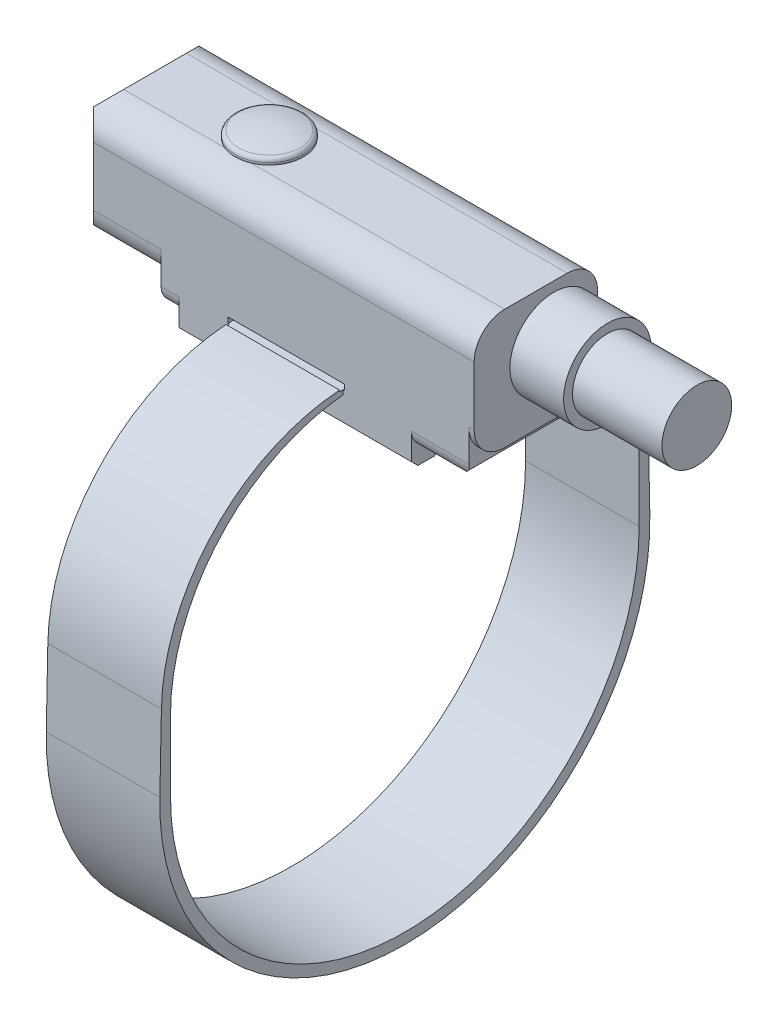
ISO-10303-21;
HEADER;
FILE_DESCRIPTION(('STEP AP214'),'2;1');
FILE_NAME('part.step','',(''),(''),'','','');
FILE_SCHEMA(('AUTOMOTIVE_DESIGN { 1 0 10303 214 1 1 1 1 }'));
ENDSEC;
DATA;
#1=APPLICATION_CONTEXT('core data for automotive mechanical design processes');
#2=APPLICATION_PROTOCOL_DEFINITION('international standard','automotive_design',2000,#1);
#3=PRODUCT_CONTEXT('',#1,'mechanical');
#4=PRODUCT('Part','Part','',(#3));
#5=PRODUCT_RELATED_PRODUCT_CATEGORY('part','',(#4));
#6=PRODUCT_DEFINITION_FORMATION('','',#4);
#7=PRODUCT_DEFINITION_CONTEXT('part definition',#1,'design');
#8=PRODUCT_DEFINITION('design','',#6,#7);
#9=PRODUCT_DEFINITION_SHAPE('','',#8);
#10=(LENGTH_UNIT() NAMED_UNIT(*) SI_UNIT(.MILLI.,.METRE.));
#11=(NAMED_UNIT(*) PLANE_ANGLE_UNIT() SI_UNIT($,.RADIAN.));
#12=(NAMED_UNIT(*) SI_UNIT($,.STERADIAN.) SOLID_ANGLE_UNIT());
#13=UNCERTAINTY_MEASURE_WITH_UNIT(LENGTH_MEASURE(1.E-05),#10,'distance_accuracy_value','');
#14=(GEOMETRIC_REPRESENTATION_CONTEXT(3) GLOBAL_UNCERTAINTY_ASSIGNED_CONTEXT((#13)) GLOBAL_UNIT_ASSIGNED_CONTEXT((#10,
#11,#12)) REPRESENTATION_CONTEXT('',''));
#15=CARTESIAN_POINT('',(0.,0.,0.));
#16=DIRECTION('',(0.,0.,1.));
#17=DIRECTION('',(1.,0.,0.));
#18=AXIS2_PLACEMENT_3D('',#15,#16,#17);
#19=CARTESIAN_POINT('',(18.5,21.6,-1.75));
#20=DIRECTION('',(0.,-1.,0.));
#21=DIRECTION('',(0.,0.,-1.));
#22=AXIS2_PLACEMENT_3D('',#19,#20,#21);
#23=PLANE('',#22);
#24=CARTESIAN_POINT('',(7.1,21.6,0.));
#25=DIRECTION('',(0.,-1.,0.));
#26=DIRECTION('',(0.,0.,-1.));
#27=AXIS2_PLACEMENT_3D('',#24,#25,#26);
#28=CIRCLE('',#27,1.9);
#29=CARTESIAN_POINT('',(6.36006757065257,21.6,-1.75));
#30=VERTEX_POINT('',#29);
#31=CARTESIAN_POINT('',(6.36006757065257,21.6,1.75));
#32=VERTEX_POINT('',#31);
#33=EDGE_CURVE('E11',#30,#32,#28,.F.);
#34=ORIENTED_EDGE('',*,*,#33,.F.);
#35=DIRECTION('',(-1.,0.,0.));
#36=VECTOR('',#35,1.);
#37=CARTESIAN_POINT('',(18.5,21.6,-1.75));
#38=LINE('',#37,#36);
#39=CARTESIAN_POINT('',(0.707106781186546,21.6,-1.75));
#40=VERTEX_POINT('',#39);
#41=EDGE_CURVE('E363',#30,#40,#38,.T.);
#42=ORIENTED_EDGE('',*,*,#41,.T.);
#43=DIRECTION('',(0.,0.,1.));
#44=VECTOR('',#43,1.);
#45=CARTESIAN_POINT('',(0.707106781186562,21.6,-1.75));
#46=LINE('',#45,#44);
#47=CARTESIAN_POINT('',(0.707106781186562,21.6,1.75));
#48=VERTEX_POINT('',#47);
#49=EDGE_CURVE('E629',#40,#48,#46,.T.);
#50=ORIENTED_EDGE('',*,*,#49,.T.);
#51=DIRECTION('',(-1.,0.,0.));
#52=VECTOR('',#51,1.);
#53=CARTESIAN_POINT('',(18.5,21.6,1.75));
#54=LINE('',#53,#52);
#55=EDGE_CURVE('E31',#32,#48,#54,.T.);
#56=ORIENTED_EDGE('',*,*,#55,.F.);
#57=EDGE_LOOP('',(#34,#42,#50,#56));
#58=FACE_BOUND('',#57,.T.);
#59=ADVANCED_FACE('F16',(#58),#23,.F.);
#60=CARTESIAN_POINT('',(18.5,19.9,1.75));
#61=DIRECTION('',(1.,0.,0.));
#62=DIRECTION('',(0.,0.,-1.));
#63=AXIS2_PLACEMENT_3D('',#60,#61,#62);
#64=PLANE('',#63);
#65=DIRECTION('',(0.,0.,-1.));
#66=VECTOR('',#65,1.);
#67=CARTESIAN_POINT('',(18.5,13.8,2.45));
#68=LINE('',#67,#66);
#69=CARTESIAN_POINT('',(18.5,13.8,2.45));
#70=VERTEX_POINT('',#69);
#71=CARTESIAN_POINT('',(18.5,13.8,-2.45));
#72=VERTEX_POINT('',#71);
#73=EDGE_CURVE('E455',#70,#72,#68,.T.);
#74=ORIENTED_EDGE('',*,*,#73,.F.);
#75=CARTESIAN_POINT('',(18.5,14.8,2.45));
#76=DIRECTION('',(1.,0.,0.));
#77=DIRECTION('',(0.,0.,-1.));
#78=AXIS2_PLACEMENT_3D('',#75,#76,#77);
#79=CIRCLE('',#78,1.);
#80=CARTESIAN_POINT('',(18.5,14.8,3.45));
#81=VERTEX_POINT('',#80);
#82=EDGE_CURVE('E435',#81,#70,#79,.T.);
#83=ORIENTED_EDGE('',*,*,#82,.F.);
#84=DIRECTION('',(0.,-1.,0.));
#85=VECTOR('',#84,1.);
#86=CARTESIAN_POINT('',(18.5,19.9,3.45));
#87=LINE('',#86,#85);
#88=CARTESIAN_POINT('',(18.5,13.3146490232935,3.45));
#89=VERTEX_POINT('',#88);
#90=EDGE_CURVE('E614',#81,#89,#87,.T.);
#91=ORIENTED_EDGE('',*,*,#90,.T.);
#92=DIRECTION('',(0.,-0.707106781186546,-0.707106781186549));
#93=VECTOR('',#92,1.);
#94=CARTESIAN_POINT('',(18.5,13.3146490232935,3.45));
#95=LINE('',#94,#93);
#96=CARTESIAN_POINT('',(18.5,12.9610956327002,3.09644660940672));
#97=VERTEX_POINT('',#96);
#98=EDGE_CURVE('E617',#89,#97,#95,.T.);
#99=ORIENTED_EDGE('',*,*,#98,.T.);
#100=DIRECTION('',(0.,0.,-1.));
#101=VECTOR('',#100,1.);
#102=CARTESIAN_POINT('',(18.5,12.9610956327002,3.09644660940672));
#103=LINE('',#102,#101);
#104=CARTESIAN_POINT('',(18.5,12.9610956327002,2.18));
#105=VERTEX_POINT('',#104);
#106=EDGE_CURVE('E1037',#97,#105,#103,.T.);
#107=ORIENTED_EDGE('',*,*,#106,.T.);
#108=CARTESIAN_POINT('',(18.5,8.46136230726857,0.));
#109=DIRECTION('',(1.,0.,0.));
#110=DIRECTION('',(0.,0.,-1.));
#111=AXIS2_PLACEMENT_3D('',#108,#109,#110);
#112=CIRCLE('',#111,5.);
#113=CARTESIAN_POINT('',(18.5,12.9610956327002,-2.18));
#114=VERTEX_POINT('',#113);
#115=EDGE_CURVE('E548',#114,#105,#112,.T.);
#116=ORIENTED_EDGE('',*,*,#115,.F.);
#117=DIRECTION('',(0.,0.,-1.));
#118=VECTOR('',#117,1.);
#119=CARTESIAN_POINT('',(18.5,12.9610956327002,-2.5));
#120=LINE('',#119,#118);
#121=CARTESIAN_POINT('',(18.5,12.9610956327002,-3.09644660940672));
#122=VERTEX_POINT('',#121);
#123=EDGE_CURVE('E1019',#114,#122,#120,.T.);
#124=ORIENTED_EDGE('',*,*,#123,.T.);
#125=DIRECTION('',(0.,0.707106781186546,-0.707106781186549));
#126=VECTOR('',#125,1.);
#127=CARTESIAN_POINT('',(18.5,12.9610956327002,-3.09644660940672));
#128=LINE('',#127,#126);
#129=CARTESIAN_POINT('',(18.5,13.3146490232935,-3.45));
#130=VERTEX_POINT('',#129);
#131=EDGE_CURVE('E874',#122,#130,#128,.T.);
#132=ORIENTED_EDGE('',*,*,#131,.T.);
#133=DIRECTION('',(0.,1.,0.));
#134=VECTOR('',#133,1.);
#135=CARTESIAN_POINT('',(18.5,13.3146490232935,-3.45));
#136=LINE('',#135,#134);
#137=CARTESIAN_POINT('',(18.5,14.8,-3.45));
#138=VERTEX_POINT('',#137);
#139=EDGE_CURVE('E870',#130,#138,#136,.T.);
#140=ORIENTED_EDGE('',*,*,#139,.T.);
#141=CARTESIAN_POINT('',(18.5,14.8,-2.45));
#142=DIRECTION('',(1.,0.,0.));
#143=DIRECTION('',(0.,0.,-1.));
#144=AXIS2_PLACEMENT_3D('',#141,#142,#143);
#145=CIRCLE('',#144,1.);
#146=EDGE_CURVE('E440',#72,#138,#145,.T.);
#147=ORIENTED_EDGE('',*,*,#146,.F.);
#148=EDGE_LOOP('',(#74,#83,#91,#99,#107,#116,#124,#132,#140,#147));
#149=FACE_BOUND('',#148,.T.);
#150=ADVANCED_FACE('F701',(#149),#64,.T.);
#151=CARTESIAN_POINT('',(5.5,14.8,-2.45));
#152=DIRECTION('',(-1.,0.,0.));
#153=DIRECTION('',(0.,0.,1.));
#154=AXIS2_PLACEMENT_3D('',#151,#152,#153);
#155=PLANE('',#154);
#156=DIRECTION('',(0.,0.,-1.));
#157=VECTOR('',#156,1.);
#158=CARTESIAN_POINT('',(5.5,12.9610956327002,-2.5));
#159=LINE('',#158,#157);
#160=CARTESIAN_POINT('',(5.5,12.9610956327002,-2.18));
#161=VERTEX_POINT('',#160);
#162=CARTESIAN_POINT('',(5.5,12.9610956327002,-3.09644660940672));
#163=VERTEX_POINT('',#162);
#164=EDGE_CURVE('E565',#161,#163,#159,.T.);
#165=ORIENTED_EDGE('',*,*,#164,.F.);
#166=CARTESIAN_POINT('',(5.5,8.46136230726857,0.));
#167=DIRECTION('',(-1.,0.,0.));
#168=DIRECTION('',(0.,0.,1.));
#169=AXIS2_PLACEMENT_3D('',#166,#167,#168);
#170=CIRCLE('',#169,5.);
#171=CARTESIAN_POINT('',(5.5,12.9610956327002,2.18));
#172=VERTEX_POINT('',#171);
#173=EDGE_CURVE('E866',#161,#172,#170,.F.);
#174=ORIENTED_EDGE('',*,*,#173,.T.);
#175=DIRECTION('',(0.,0.,-1.));
#176=VECTOR('',#175,1.);
#177=CARTESIAN_POINT('',(5.5,12.9610956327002,3.09644660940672));
#178=LINE('',#177,#176);
#179=CARTESIAN_POINT('',(5.5,12.9610956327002,3.09644660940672));
#180=VERTEX_POINT('',#179);
#181=EDGE_CURVE('E563',#180,#172,#178,.T.);
#182=ORIENTED_EDGE('',*,*,#181,.F.);
#183=DIRECTION('',(0.,-0.707106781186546,-0.707106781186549));
#184=VECTOR('',#183,1.);
#185=CARTESIAN_POINT('',(5.5,13.3146490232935,3.45));
#186=LINE('',#185,#184);
#187=CARTESIAN_POINT('',(5.5,13.3146490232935,3.45));
#188=VERTEX_POINT('',#187);
#189=EDGE_CURVE('E560',#188,#180,#186,.T.);
#190=ORIENTED_EDGE('',*,*,#189,.F.);
#191=DIRECTION('',(0.,-1.,0.));
#192=VECTOR('',#191,1.);
#193=CARTESIAN_POINT('',(5.5,14.8,3.45));
#194=LINE('',#193,#192);
#195=CARTESIAN_POINT('',(5.5,14.8,3.45));
#196=VERTEX_POINT('',#195);
#197=EDGE_CURVE('E557',#196,#188,#194,.T.);
#198=ORIENTED_EDGE('',*,*,#197,.F.);
#199=CARTESIAN_POINT('',(5.5,14.8,2.45));
#200=DIRECTION('',(-1.,0.,0.));
#201=DIRECTION('',(0.,0.,1.));
#202=AXIS2_PLACEMENT_3D('',#199,#200,#201);
#203=CIRCLE('',#202,1.);
#204=CARTESIAN_POINT('',(5.5,13.8,2.45));
#205=VERTEX_POINT('',#204);
#206=EDGE_CURVE('E578',#205,#196,#203,.T.);
#207=ORIENTED_EDGE('',*,*,#206,.F.);
#208=DIRECTION('',(0.,0.,1.));
#209=VECTOR('',#208,1.);
#210=CARTESIAN_POINT('',(5.5,13.8,-2.45));
#211=LINE('',#210,#209);
#212=CARTESIAN_POINT('',(5.5,13.8,-2.45));
#213=VERTEX_POINT('',#212);
#214=EDGE_CURVE('E576',#213,#205,#211,.T.);
#215=ORIENTED_EDGE('',*,*,#214,.F.);
#216=CARTESIAN_POINT('',(5.5,14.8,-2.45));
#217=DIRECTION('',(-1.,0.,0.));
#218=DIRECTION('',(0.,0.,1.));
#219=AXIS2_PLACEMENT_3D('',#216,#217,#218);
#220=CIRCLE('',#219,1.);
#221=CARTESIAN_POINT('',(5.5,14.8,-3.45));
#222=VERTEX_POINT('',#221);
#223=EDGE_CURVE('E574',#222,#213,#220,.T.);
#224=ORIENTED_EDGE('',*,*,#223,.F.);
#225=DIRECTION('',(0.,1.,0.));
#226=VECTOR('',#225,1.);
#227=CARTESIAN_POINT('',(5.5,13.3146490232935,-3.45));
#228=LINE('',#227,#226);
#229=CARTESIAN_POINT('',(5.5,13.3146490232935,-3.45));
#230=VERTEX_POINT('',#229);
#231=EDGE_CURVE('E571',#230,#222,#228,.T.);
#232=ORIENTED_EDGE('',*,*,#231,.F.);
#233=DIRECTION('',(0.,0.707106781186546,-0.707106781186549));
#234=VECTOR('',#233,1.);
#235=CARTESIAN_POINT('',(5.5,12.9610956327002,-3.09644660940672));
#236=LINE('',#235,#234);
#237=EDGE_CURVE('E568',#163,#230,#236,.T.);
#238=ORIENTED_EDGE('',*,*,#237,.F.);
#239=EDGE_LOOP('',(#165,#174,#182,#190,#198,#207,#215,#224,#232,#238));
#240=FACE_BOUND('',#239,.T.);
#241=ADVANCED_FACE('F706',(#240),#155,.T.);
#242=CARTESIAN_POINT('',(18.5,19.9,3.45));
#243=DIRECTION('',(0.,0.,-1.));
#244=DIRECTION('',(0.,1.,0.));
#245=AXIS2_PLACEMENT_3D('',#242,#243,#244);
#246=PLANE('',#245);
#247=DIRECTION('',(-1.,0.,0.));
#248=VECTOR('',#247,1.);
#249=CARTESIAN_POINT('',(18.5,19.9,3.45));
#250=LINE('',#249,#248);
#251=CARTESIAN_POINT('',(22.,19.9,3.45));
#252=VERTEX_POINT('',#251);
#253=CARTESIAN_POINT('',(0.707106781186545,19.9,3.45));
#254=VERTEX_POINT('',#253);
#255=EDGE_CURVE('E673',#252,#254,#250,.T.);
#256=ORIENTED_EDGE('',*,*,#255,.T.);
#257=DIRECTION('',(0.,1.,0.));
#258=VECTOR('',#257,1.);
#259=CARTESIAN_POINT('',(0.707106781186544,11.6,3.45));
#260=LINE('',#259,#258);
#261=CARTESIAN_POINT('',(0.707106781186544,16.6,3.45));
#262=VERTEX_POINT('',#261);
#263=EDGE_CURVE('E382',#262,#254,#260,.T.);
#264=ORIENTED_EDGE('',*,*,#263,.F.);
#265=DIRECTION('',(-1.,0.,0.));
#266=VECTOR('',#265,1.);
#267=CARTESIAN_POINT('',(4.5,16.6,3.45));
#268=LINE('',#267,#266);
#269=CARTESIAN_POINT('',(4.5,16.6,3.45));
#270=VERTEX_POINT('',#269);
#271=EDGE_CURVE('E602',#270,#262,#268,.T.);
#272=ORIENTED_EDGE('',*,*,#271,.F.);
#273=DIRECTION('',(0.,-1.,0.));
#274=VECTOR('',#273,1.);
#275=CARTESIAN_POINT('',(4.5,16.6,3.45));
#276=LINE('',#275,#274);
#277=CARTESIAN_POINT('',(4.5,14.8,3.45));
#278=VERTEX_POINT('',#277);
#279=EDGE_CURVE('E591',#270,#278,#276,.T.);
#280=ORIENTED_EDGE('',*,*,#279,.T.);
#281=DIRECTION('',(-1.,0.,0.));
#282=VECTOR('',#281,1.);
#283=CARTESIAN_POINT('',(5.5,14.8,3.45));
#284=LINE('',#283,#282);
#285=EDGE_CURVE('E580',#196,#278,#284,.T.);
#286=ORIENTED_EDGE('',*,*,#285,.F.);
#287=ORIENTED_EDGE('',*,*,#197,.T.);
#288=DIRECTION('',(-1.,0.,0.));
#289=VECTOR('',#288,1.);
#290=CARTESIAN_POINT('',(18.5,13.3146490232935,3.45));
#291=LINE('',#290,#289);
#292=EDGE_CURVE('E892',#89,#188,#291,.T.);
#293=ORIENTED_EDGE('',*,*,#292,.F.);
#294=ORIENTED_EDGE('',*,*,#90,.F.);
#295=DIRECTION('',(-1.,0.,0.));
#296=VECTOR('',#295,1.);
#297=CARTESIAN_POINT('',(21.7,14.8,3.45));
#298=LINE('',#297,#296);
#299=CARTESIAN_POINT('',(21.7,14.8,3.45));
#300=VERTEX_POINT('',#299);
#301=EDGE_CURVE('E452',#300,#81,#298,.T.);
#302=ORIENTED_EDGE('',*,*,#301,.F.);
#303=DIRECTION('',(0.,-1.,0.));
#304=VECTOR('',#303,1.);
#305=CARTESIAN_POINT('',(21.7,16.6,3.45));
#306=LINE('',#305,#304);
#307=CARTESIAN_POINT('',(21.7,16.6,3.45));
#308=VERTEX_POINT('',#307);
#309=EDGE_CURVE('E450',#308,#300,#306,.T.);
#310=ORIENTED_EDGE('',*,*,#309,.F.);
#311=DIRECTION('',(-1.,0.,0.));
#312=VECTOR('',#311,1.);
#313=CARTESIAN_POINT('',(22.,16.6,3.45));
#314=LINE('',#313,#312);
#315=CARTESIAN_POINT('',(22.,16.6,3.45));
#316=VERTEX_POINT('',#315);
#317=EDGE_CURVE('E547',#316,#308,#314,.T.);
#318=ORIENTED_EDGE('',*,*,#317,.F.);
#319=DIRECTION('',(0.,-1.,0.));
#320=VECTOR('',#319,1.);
#321=CARTESIAN_POINT('',(22.,19.9,3.45));
#322=LINE('',#321,#320);
#323=EDGE_CURVE('E525',#252,#316,#322,.T.);
#324=ORIENTED_EDGE('',*,*,#323,.F.);
#325=EDGE_LOOP('',(#256,#264,#272,#280,#286,#287,#293,#294,#302,#310,#318,#324));
#326=FACE_BOUND('',#325,.T.);
#327=DIRECTION('',(0.,1.,0.));
#328=VECTOR('',#327,1.);
#329=CARTESIAN_POINT('',(8.325,0.,3.45));
#330=LINE('',#329,#328);
#331=CARTESIAN_POINT('',(8.325,14.6483566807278,3.45));
#332=VERTEX_POINT('',#331);
#333=CARTESIAN_POINT('',(8.325,14.9,3.45));
#334=VERTEX_POINT('',#333);
#335=EDGE_CURVE('E855',#332,#334,#330,.T.);
#336=ORIENTED_EDGE('',*,*,#335,.T.);
#337=DIRECTION('',(-1.,0.,0.));
#338=VECTOR('',#337,1.);
#339=CARTESIAN_POINT('',(18.5,14.9,3.45));
#340=LINE('',#339,#338);
#341=CARTESIAN_POINT('',(8.25,14.9,3.45));
#342=VERTEX_POINT('',#341);
#343=EDGE_CURVE('E505',#334,#342,#340,.T.);
#344=ORIENTED_EDGE('',*,*,#343,.T.);
#345=DIRECTION('',(0.,-1.,0.));
#346=VECTOR('',#345,1.);
#347=CARTESIAN_POINT('',(8.25,19.9,3.45));
#348=LINE('',#347,#346);
#349=CARTESIAN_POINT('',(8.25,15.2,3.45));
#350=VERTEX_POINT('',#349);
#351=EDGE_CURVE('E496',#350,#342,#348,.T.);
#352=ORIENTED_EDGE('',*,*,#351,.F.);
#353=DIRECTION('',(1.,0.,0.));
#354=VECTOR('',#353,1.);
#355=CARTESIAN_POINT('',(18.5,15.2,3.45));
#356=LINE('',#355,#354);
#357=CARTESIAN_POINT('',(14.75,15.2,3.45));
#358=VERTEX_POINT('',#357);
#359=EDGE_CURVE('E509',#350,#358,#356,.T.);
#360=ORIENTED_EDGE('',*,*,#359,.T.);
#361=DIRECTION('',(0.,-1.,0.));
#362=VECTOR('',#361,1.);
#363=CARTESIAN_POINT('',(14.75,19.9,3.45));
#364=LINE('',#363,#362);
#365=CARTESIAN_POINT('',(14.75,14.9,3.45));
#366=VERTEX_POINT('',#365);
#367=EDGE_CURVE('E491',#358,#366,#364,.T.);
#368=ORIENTED_EDGE('',*,*,#367,.T.);
#369=CARTESIAN_POINT('',(14.675,14.9,3.45));
#370=VERTEX_POINT('',#369);
#371=EDGE_CURVE('E508',#366,#370,#340,.T.);
#372=ORIENTED_EDGE('',*,*,#371,.T.);
#373=DIRECTION('',(0.,1.,0.));
#374=VECTOR('',#373,1.);
#375=CARTESIAN_POINT('',(14.675,0.,3.45));
#376=LINE('',#375,#374);
#377=CARTESIAN_POINT('',(14.675,14.6483566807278,3.45));
#378=VERTEX_POINT('',#377);
#379=EDGE_CURVE('E903',#378,#370,#376,.T.);
#380=ORIENTED_EDGE('',*,*,#379,.F.);
#381=DIRECTION('',(-1.,0.,0.));
#382=VECTOR('',#381,1.);
#383=CARTESIAN_POINT('',(14.675,14.6483566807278,3.45));
#384=LINE('',#383,#382);
#385=EDGE_CURVE('E901',#332,#378,#384,.F.);
#386=ORIENTED_EDGE('',*,*,#385,.F.);
#387=EDGE_LOOP('',(#336,#344,#352,#360,#368,#372,#380,#386));
#388=FACE_BOUND('',#387,.T.);
#389=ADVANCED_FACE('F669',(#326,#388),#246,.F.);
#390=CARTESIAN_POINT('',(18.5,13.3146490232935,3.45));
#391=DIRECTION('',(0.,0.707106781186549,-0.707106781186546));
#392=DIRECTION('',(0.,0.707106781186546,0.707106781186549));
#393=AXIS2_PLACEMENT_3D('',#390,#391,#392);
#394=PLANE('',#393);
#395=ORIENTED_EDGE('',*,*,#189,.T.);
#396=DIRECTION('',(-1.,0.,0.));
#397=VECTOR('',#396,1.);
#398=CARTESIAN_POINT('',(18.5,12.9610956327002,3.09644660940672));
#399=LINE('',#398,#397);
#400=EDGE_CURVE('E889',#97,#180,#399,.T.);
#401=ORIENTED_EDGE('',*,*,#400,.F.);
#402=ORIENTED_EDGE('',*,*,#98,.F.);
#403=ORIENTED_EDGE('',*,*,#292,.T.);
#404=EDGE_LOOP('',(#395,#401,#402,#403));
#405=FACE_BOUND('',#404,.T.);
#406=ADVANCED_FACE('F726',(#405),#394,.F.);
#407=CARTESIAN_POINT('',(18.5,12.9610956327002,3.09644660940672));
#408=DIRECTION('',(0.,1.,0.));
#409=DIRECTION('',(0.,0.,1.));
#410=AXIS2_PLACEMENT_3D('',#407,#408,#409);
#411=PLANE('',#410);
#412=ORIENTED_EDGE('',*,*,#181,.T.);
#413=DIRECTION('',(-1.,0.,0.));
#414=VECTOR('',#413,1.);
#415=CARTESIAN_POINT('',(18.5,12.9610956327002,2.18));
#416=LINE('',#415,#414);
#417=EDGE_CURVE('E551',#105,#172,#416,.T.);
#418=ORIENTED_EDGE('',*,*,#417,.F.);
#419=ORIENTED_EDGE('',*,*,#106,.F.);
#420=ORIENTED_EDGE('',*,*,#400,.T.);
#421=EDGE_LOOP('',(#412,#418,#419,#420));
#422=FACE_BOUND('',#421,.T.);
#423=ADVANCED_FACE('F722',(#422),#411,.F.);
#424=CARTESIAN_POINT('',(18.5,12.9610956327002,-2.5));
#425=DIRECTION('',(0.,1.,0.));
#426=DIRECTION('',(0.,0.,1.));
#427=AXIS2_PLACEMENT_3D('',#424,#425,#426);
#428=PLANE('',#427);
#429=ORIENTED_EDGE('',*,*,#164,.T.);
#430=DIRECTION('',(-1.,0.,0.));
#431=VECTOR('',#430,1.);
#432=CARTESIAN_POINT('',(18.5,12.9610956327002,-3.09644660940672));
#433=LINE('',#432,#431);
#434=EDGE_CURVE('E886',#122,#163,#433,.T.);
#435=ORIENTED_EDGE('',*,*,#434,.F.);
#436=ORIENTED_EDGE('',*,*,#123,.F.);
#437=DIRECTION('',(-1.,0.,0.));
#438=VECTOR('',#437,1.);
#439=CARTESIAN_POINT('',(18.5,12.9610956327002,-2.18));
#440=LINE('',#439,#438);
#441=EDGE_CURVE('E554',#114,#161,#440,.T.);
#442=ORIENTED_EDGE('',*,*,#441,.T.);
#443=EDGE_LOOP('',(#429,#435,#436,#442));
#444=FACE_BOUND('',#443,.T.);
#445=ADVANCED_FACE('F718',(#444),#428,.F.);
#446=CARTESIAN_POINT('',(18.5,12.9610956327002,-3.09644660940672));
#447=DIRECTION('',(0.,0.707106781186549,0.707106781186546));
#448=DIRECTION('',(0.,-0.707106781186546,0.707106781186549));
#449=AXIS2_PLACEMENT_3D('',#446,#447,#448);
#450=PLANE('',#449);
#451=ORIENTED_EDGE('',*,*,#237,.T.);
#452=DIRECTION('',(-1.,0.,0.));
#453=VECTOR('',#452,1.);
#454=CARTESIAN_POINT('',(18.5,13.3146490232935,-3.45));
#455=LINE('',#454,#453);
#456=EDGE_CURVE('E883',#130,#230,#455,.T.);
#457=ORIENTED_EDGE('',*,*,#456,.F.);
#458=ORIENTED_EDGE('',*,*,#131,.F.);
#459=ORIENTED_EDGE('',*,*,#434,.T.);
#460=EDGE_LOOP('',(#451,#457,#458,#459));
#461=FACE_BOUND('',#460,.T.);
#462=ADVANCED_FACE('F715',(#461),#450,.F.);
#463=CARTESIAN_POINT('',(4.5,16.6,-1.75));
#464=DIRECTION('',(-1.,0.,0.));
#465=DIRECTION('',(0.,0.,1.));
#466=AXIS2_PLACEMENT_3D('',#463,#464,#465);
#467=PLANE('',#466);
#468=DIRECTION('',(0.,1.,0.));
#469=VECTOR('',#468,1.);
#470=CARTESIAN_POINT('',(4.5,13.3146490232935,-3.45));
#471=LINE('',#470,#469);
#472=CARTESIAN_POINT('',(4.5,14.8,-3.45));
#473=VERTEX_POINT('',#472);
#474=CARTESIAN_POINT('',(4.5,16.6,-3.45));
#475=VERTEX_POINT('',#474);
#476=EDGE_CURVE('E594',#473,#475,#471,.T.);
#477=ORIENTED_EDGE('',*,*,#476,.F.);
#478=CARTESIAN_POINT('',(4.5,14.8,-2.45));
#479=DIRECTION('',(-1.,0.,0.));
#480=DIRECTION('',(0.,0.,1.));
#481=AXIS2_PLACEMENT_3D('',#478,#479,#480);
#482=CIRCLE('',#481,1.);
#483=CARTESIAN_POINT('',(4.5,13.8,-2.45));
#484=VERTEX_POINT('',#483);
#485=EDGE_CURVE('E863',#473,#484,#482,.T.);
#486=ORIENTED_EDGE('',*,*,#485,.T.);
#487=DIRECTION('',(0.,0.,1.));
#488=VECTOR('',#487,1.);
#489=CARTESIAN_POINT('',(4.5,13.8,-1.75));
#490=LINE('',#489,#488);
#491=CARTESIAN_POINT('',(4.5,13.8,2.45));
#492=VERTEX_POINT('',#491);
#493=EDGE_CURVE('E860',#484,#492,#490,.T.);
#494=ORIENTED_EDGE('',*,*,#493,.T.);
#495=CARTESIAN_POINT('',(4.5,14.8,2.45));
#496=DIRECTION('',(-1.,0.,0.));
#497=DIRECTION('',(0.,0.,1.));
#498=AXIS2_PLACEMENT_3D('',#495,#496,#497);
#499=CIRCLE('',#498,1.);
#500=EDGE_CURVE('E858',#492,#278,#499,.T.);
#501=ORIENTED_EDGE('',*,*,#500,.T.);
#502=ORIENTED_EDGE('',*,*,#279,.F.);
#503=CARTESIAN_POINT('',(4.5,16.6,1.75));
#504=DIRECTION('',(-1.,0.,0.));
#505=DIRECTION('',(0.,0.,1.));
#506=AXIS2_PLACEMENT_3D('',#503,#504,#505);
#507=CIRCLE('',#506,1.7);
#508=CARTESIAN_POINT('',(4.5,14.9,1.75));
#509=VERTEX_POINT('',#508);
#510=EDGE_CURVE('E600',#509,#270,#507,.T.);
#511=ORIENTED_EDGE('',*,*,#510,.F.);
#512=DIRECTION('',(0.,0.,1.));
#513=VECTOR('',#512,1.);
#514=CARTESIAN_POINT('',(4.5,14.9,-1.75));
#515=LINE('',#514,#513);
#516=CARTESIAN_POINT('',(4.5,14.9,-1.75));
#517=VERTEX_POINT('',#516);
#518=EDGE_CURVE('E598',#517,#509,#515,.T.);
#519=ORIENTED_EDGE('',*,*,#518,.F.);
#520=CARTESIAN_POINT('',(4.5,16.6,-1.75));
#521=DIRECTION('',(-1.,0.,0.));
#522=DIRECTION('',(0.,0.,1.));
#523=AXIS2_PLACEMENT_3D('',#520,#521,#522);
#524=CIRCLE('',#523,1.7);
#525=EDGE_CURVE('E596',#475,#517,#524,.T.);
#526=ORIENTED_EDGE('',*,*,#525,.F.);
#527=EDGE_LOOP('',(#477,#486,#494,#501,#502,#511,#519,#526));
#528=FACE_BOUND('',#527,.T.);
#529=ADVANCED_FACE('F662',(#528),#467,.T.);
#530=CARTESIAN_POINT('',(0.,19.9,1.75));
#531=DIRECTION('',(1.,0.,0.));
#532=DIRECTION('',(0.,0.,-1.));
#533=AXIS2_PLACEMENT_3D('',#530,#531,#532);
#534=PLANE('',#533);
#535=DIRECTION('',(0.,0.,1.));
#536=VECTOR('',#535,1.);
#537=CARTESIAN_POINT('',(0.,20.8928932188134,-5.));
#538=LINE('',#537,#536);
#539=CARTESIAN_POINT('',(0.,20.8928932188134,-2.74289321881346));
#540=VERTEX_POINT('',#539);
#541=CARTESIAN_POINT('',(0.,20.8928932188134,2.74289321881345));
#542=VERTEX_POINT('',#541);
#543=EDGE_CURVE('E412',#540,#542,#538,.T.);
#544=ORIENTED_EDGE('',*,*,#543,.F.);
#545=DIRECTION('',(0.,1.,0.));
#546=VECTOR('',#545,1.);
#547=CARTESIAN_POINT('',(0.,11.6,-2.74289321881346));
#548=LINE('',#547,#546);
#549=CARTESIAN_POINT('',(0.,15.6071067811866,-2.74289321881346));
#550=VERTEX_POINT('',#549);
#551=EDGE_CURVE('E392',#550,#540,#548,.T.);
#552=ORIENTED_EDGE('',*,*,#551,.F.);
#553=DIRECTION('',(0.,0.,1.));
#554=VECTOR('',#553,1.);
#555=CARTESIAN_POINT('',(0.,15.6071067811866,-5.));
#556=LINE('',#555,#554);
#557=CARTESIAN_POINT('',(0.,15.6071067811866,2.74289321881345));
#558=VERTEX_POINT('',#557);
#559=EDGE_CURVE('E416',#550,#558,#556,.T.);
#560=ORIENTED_EDGE('',*,*,#559,.T.);
#561=DIRECTION('',(0.,1.,0.));
#562=VECTOR('',#561,1.);
#563=CARTESIAN_POINT('',(0.,11.6,2.74289321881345));
#564=LINE('',#563,#562);
#565=EDGE_CURVE('E383',#558,#542,#564,.T.);
#566=ORIENTED_EDGE('',*,*,#565,.T.);
#567=EDGE_LOOP('',(#544,#552,#560,#566));
#568=FACE_BOUND('',#567,.T.);
#569=ADVANCED_FACE('F642',(#568),#534,.F.);
#570=CARTESIAN_POINT('',(14.675,0.,0.));
#571=DIRECTION('',(1.,0.,0.));
#572=DIRECTION('',(0.,0.,-1.));
#573=AXIS2_PLACEMENT_3D('',#570,#571,#572);
#574=PLANE('',#573);
#575=DIRECTION('',(0.,-1.,0.));
#576=VECTOR('',#575,1.);
#577=CARTESIAN_POINT('',(14.675,0.,3.65));
#578=LINE('',#577,#576);
#579=CARTESIAN_POINT('',(14.675,14.9746440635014,3.65));
#580=VERTEX_POINT('',#579);
#581=CARTESIAN_POINT('',(14.675,14.9,3.65));
#582=VERTEX_POINT('',#581);
#583=EDGE_CURVE('E520',#580,#582,#578,.T.);
#584=ORIENTED_EDGE('',*,*,#583,.F.);
#585=CARTESIAN_POINT('',(14.675,4.3,2.91381108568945));
#586=DIRECTION('',(1.,0.,0.));
#587=DIRECTION('',(0.,0.,-1.));
#588=AXIS2_PLACEMENT_3D('',#585,#586,#587);
#589=CIRCLE('',#588,10.7);
#590=CARTESIAN_POINT('',(14.675,4.51594687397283,13.6116317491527));
#591=VERTEX_POINT('',#590);
#592=EDGE_CURVE('E845',#580,#591,#589,.T.);
#593=ORIENTED_EDGE('',*,*,#592,.T.);
#594=DIRECTION('',(0.,-0.999796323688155,0.0201819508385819));
#595=VECTOR('',#594,1.);
#596=CARTESIAN_POINT('',(14.675,4.51594687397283,13.6116317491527));
#597=LINE('',#596,#595);
#598=CARTESIAN_POINT('',(14.675,0.276492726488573,13.6972096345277));
#599=VERTEX_POINT('',#598);
#600=EDGE_CURVE('E847',#591,#599,#597,.T.);
#601=ORIENTED_EDGE('',*,*,#600,.T.);
#602=CARTESIAN_POINT('',(14.675,0.,0.));
#603=DIRECTION('',(1.,0.,0.));
#604=DIRECTION('',(0.,0.,-1.));
#605=AXIS2_PLACEMENT_3D('',#602,#603,#604);
#606=CIRCLE('',#605,13.7);
#607=CARTESIAN_POINT('',(14.675,0.276492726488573,-13.6972096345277));
#608=VERTEX_POINT('',#607);
#609=EDGE_CURVE('E839',#599,#608,#606,.T.);
#610=ORIENTED_EDGE('',*,*,#609,.T.);
#611=DIRECTION('',(0.,0.999796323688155,0.0201819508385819));
#612=VECTOR('',#611,1.);
#613=CARTESIAN_POINT('',(14.675,0.276492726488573,-13.6972096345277));
#614=LINE('',#613,#612);
#615=CARTESIAN_POINT('',(14.675,4.51594687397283,-13.6116317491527));
#616=VERTEX_POINT('',#615);
#617=EDGE_CURVE('E788',#608,#616,#614,.T.);
#618=ORIENTED_EDGE('',*,*,#617,.T.);
#619=CARTESIAN_POINT('',(14.675,4.3,-2.91381108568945));
#620=DIRECTION('',(1.,0.,0.));
#621=DIRECTION('',(0.,0.,-1.));
#622=AXIS2_PLACEMENT_3D('',#619,#620,#621);
#623=CIRCLE('',#622,10.7);
#624=CARTESIAN_POINT('',(14.675,14.9746440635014,-3.65));
#625=VERTEX_POINT('',#624);
#626=EDGE_CURVE('E842',#616,#625,#623,.T.);
#627=ORIENTED_EDGE('',*,*,#626,.T.);
#628=DIRECTION('',(0.,1.,0.));
#629=VECTOR('',#628,1.);
#630=CARTESIAN_POINT('',(14.675,0.,-3.64999999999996));
#631=LINE('',#630,#629);
#632=CARTESIAN_POINT('',(14.675,14.9,-3.65));
#633=VERTEX_POINT('',#632);
#634=EDGE_CURVE('E515',#633,#625,#631,.T.);
#635=ORIENTED_EDGE('',*,*,#634,.F.);
#636=DIRECTION('',(0.,0.,-1.));
#637=VECTOR('',#636,1.);
#638=CARTESIAN_POINT('',(14.675,14.9,0.));
#639=LINE('',#638,#637);
#640=CARTESIAN_POINT('',(14.675,14.9,-3.45));
#641=VERTEX_POINT('',#640);
#642=EDGE_CURVE('E498',#641,#633,#639,.T.);
#643=ORIENTED_EDGE('',*,*,#642,.F.);
#644=DIRECTION('',(0.,-1.,0.));
#645=VECTOR('',#644,1.);
#646=CARTESIAN_POINT('',(14.675,0.,-3.45));
#647=LINE('',#646,#645);
#648=CARTESIAN_POINT('',(14.675,14.6483566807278,-3.45));
#649=VERTEX_POINT('',#648);
#650=EDGE_CURVE('E899',#641,#649,#647,.T.);
#651=ORIENTED_EDGE('',*,*,#650,.T.);
#652=CARTESIAN_POINT('',(14.675,4.,-2.4));
#653=DIRECTION('',(1.,0.,0.));
#654=DIRECTION('',(0.,0.,-1.));
#655=AXIS2_PLACEMENT_3D('',#652,#653,#654);
#656=CIRCLE('',#655,10.7);
#657=CARTESIAN_POINT('',(14.675,4.,-13.1));
#658=VERTEX_POINT('',#657);
#659=EDGE_CURVE('E827',#658,#649,#656,.T.);
#660=ORIENTED_EDGE('',*,*,#659,.F.);
#661=DIRECTION('',(0.,1.,0.));
#662=VECTOR('',#661,1.);
#663=CARTESIAN_POINT('',(14.675,0.,-13.1));
#664=LINE('',#663,#662);
#665=CARTESIAN_POINT('',(14.675,0.,-13.1));
#666=VERTEX_POINT('',#665);
#667=EDGE_CURVE('E825',#666,#658,#664,.T.);
#668=ORIENTED_EDGE('',*,*,#667,.F.);
#669=CARTESIAN_POINT('',(14.675,0.,0.));
#670=DIRECTION('',(1.,0.,0.));
#671=DIRECTION('',(0.,0.,-1.));
#672=AXIS2_PLACEMENT_3D('',#669,#670,#671);
#673=CIRCLE('',#672,13.1);
#674=CARTESIAN_POINT('',(14.675,0.,13.1));
#675=VERTEX_POINT('',#674);
#676=EDGE_CURVE('E823',#675,#666,#673,.T.);
#677=ORIENTED_EDGE('',*,*,#676,.F.);
#678=DIRECTION('',(0.,-1.,0.));
#679=VECTOR('',#678,1.);
#680=CARTESIAN_POINT('',(14.675,4.,13.1));
#681=LINE('',#680,#679);
#682=CARTESIAN_POINT('',(14.675,4.,13.1));
#683=VERTEX_POINT('',#682);
#684=EDGE_CURVE('E821',#683,#675,#681,.T.);
#685=ORIENTED_EDGE('',*,*,#684,.F.);
#686=CARTESIAN_POINT('',(14.675,4.,2.4));
#687=DIRECTION('',(1.,0.,0.));
#688=DIRECTION('',(0.,0.,-1.));
#689=AXIS2_PLACEMENT_3D('',#686,#687,#688);
#690=CIRCLE('',#689,10.7);
#691=EDGE_CURVE('E819',#378,#683,#690,.T.);
#692=ORIENTED_EDGE('',*,*,#691,.F.);
#693=ORIENTED_EDGE('',*,*,#379,.T.);
#694=EDGE_CURVE('E501',#582,#370,#639,.T.);
#695=ORIENTED_EDGE('',*,*,#694,.F.);
#696=EDGE_LOOP('',(#584,#593,#601,#610,#618,#627,#635,#643,#651,#660,#668,#677,#685,#692,#693,#695));
#697=FACE_BOUND('',#696,.T.);
#698=ADVANCED_FACE('F761',(#697),#574,.T.);
#699=CARTESIAN_POINT('',(14.675,4.3,-2.91381108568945));
#700=DIRECTION('',(-1.,0.,0.));
#701=DIRECTION('',(0.,0.,1.));
#702=AXIS2_PLACEMENT_3D('',#699,#700,#701);
#703=CYLINDRICAL_SURFACE('',#702,10.7);
#704=CARTESIAN_POINT('',(8.325,4.3,-2.91381108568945));
#705=DIRECTION('',(1.,0.,0.));
#706=DIRECTION('',(0.,0.,-1.));
#707=AXIS2_PLACEMENT_3D('',#704,#705,#706);
#708=CIRCLE('',#707,10.7);
#709=CARTESIAN_POINT('',(8.325,4.51594687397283,-13.6116317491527));
#710=VERTEX_POINT('',#709);
#711=CARTESIAN_POINT('',(8.325,14.9746440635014,-3.65));
#712=VERTEX_POINT('',#711);
#713=EDGE_CURVE('E803',#710,#712,#708,.T.);
#714=ORIENTED_EDGE('',*,*,#713,.T.);
#715=DIRECTION('',(-1.,0.,0.));
#716=VECTOR('',#715,1.);
#717=CARTESIAN_POINT('',(14.675,14.9746440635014,-3.65));
#718=LINE('',#717,#716);
#719=EDGE_CURVE('E512',#712,#625,#718,.F.);
#720=ORIENTED_EDGE('',*,*,#719,.T.);
#721=ORIENTED_EDGE('',*,*,#626,.F.);
#722=DIRECTION('',(-1.,0.,0.));
#723=VECTOR('',#722,1.);
#724=CARTESIAN_POINT('',(14.675,4.51594687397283,-13.6116317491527));
#725=LINE('',#724,#723);
#726=EDGE_CURVE('E793',#616,#710,#725,.T.);
#727=ORIENTED_EDGE('',*,*,#726,.T.);
#728=EDGE_LOOP('',(#714,#720,#721,#727));
#729=FACE_BOUND('',#728,.T.);
#730=ADVANCED_FACE('F764',(#729),#703,.T.);
#731=CARTESIAN_POINT('',(14.675,4.3,2.91381108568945));
#732=DIRECTION('',(-1.,0.,0.));
#733=DIRECTION('',(0.,0.,1.));
#734=AXIS2_PLACEMENT_3D('',#731,#732,#733);
#735=CYLINDRICAL_SURFACE('',#734,10.7);
#736=ORIENTED_EDGE('',*,*,#592,.F.);
#737=DIRECTION('',(-1.,0.,0.));
#738=VECTOR('',#737,1.);
#739=CARTESIAN_POINT('',(14.675,14.9746440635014,3.65));
#740=LINE('',#739,#738);
#741=CARTESIAN_POINT('',(8.325,14.9746440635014,3.65));
#742=VERTEX_POINT('',#741);
#743=EDGE_CURVE('E517',#580,#742,#740,.T.);
#744=ORIENTED_EDGE('',*,*,#743,.T.);
#745=CARTESIAN_POINT('',(8.325,4.3,2.91381108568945));
#746=DIRECTION('',(1.,0.,0.));
#747=DIRECTION('',(0.,0.,-1.));
#748=AXIS2_PLACEMENT_3D('',#745,#746,#747);
#749=CIRCLE('',#748,10.7);
#750=CARTESIAN_POINT('',(8.325,4.51594687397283,13.6116317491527));
#751=VERTEX_POINT('',#750);
#752=EDGE_CURVE('E815',#742,#751,#749,.T.);
#753=ORIENTED_EDGE('',*,*,#752,.T.);
#754=DIRECTION('',(-1.,0.,0.));
#755=VECTOR('',#754,1.);
#756=CARTESIAN_POINT('',(14.675,4.51594687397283,13.6116317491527));
#757=LINE('',#756,#755);
#758=EDGE_CURVE('E850',#591,#751,#757,.T.);
#759=ORIENTED_EDGE('',*,*,#758,.F.);
#760=EDGE_LOOP('',(#736,#744,#753,#759));
#761=FACE_BOUND('',#760,.T.);
#762=ADVANCED_FACE('F759',(#761),#735,.T.);
#763=CARTESIAN_POINT('',(14.675,4.,2.4));
#764=DIRECTION('',(-1.,0.,0.));
#765=DIRECTION('',(0.,0.,1.));
#766=AXIS2_PLACEMENT_3D('',#763,#764,#765);
#767=CYLINDRICAL_SURFACE('',#766,10.7);
#768=CARTESIAN_POINT('',(8.325,4.,2.4));
#769=DIRECTION('',(1.,0.,0.));
#770=DIRECTION('',(0.,0.,-1.));
#771=AXIS2_PLACEMENT_3D('',#768,#769,#770);
#772=CIRCLE('',#771,10.7);
#773=CARTESIAN_POINT('',(8.325,4.,13.1));
#774=VERTEX_POINT('',#773);
#775=EDGE_CURVE('E906',#332,#774,#772,.T.);
#776=ORIENTED_EDGE('',*,*,#775,.F.);
#777=ORIENTED_EDGE('',*,*,#385,.T.);
#778=ORIENTED_EDGE('',*,*,#691,.T.);
#779=DIRECTION('',(-1.,0.,0.));
#780=VECTOR('',#779,1.);
#781=CARTESIAN_POINT('',(14.675,4.,13.1));
#782=LINE('',#781,#780);
#783=EDGE_CURVE('E836',#683,#774,#782,.T.);
#784=ORIENTED_EDGE('',*,*,#783,.T.);
#785=EDGE_LOOP('',(#776,#777,#778,#784));
#786=FACE_BOUND('',#785,.T.);
#787=ADVANCED_FACE('F743',(#786),#767,.F.);
#788=CARTESIAN_POINT('',(14.675,4.,-2.4));
#789=DIRECTION('',(-1.,0.,0.));
#790=DIRECTION('',(0.,0.,1.));
#791=AXIS2_PLACEMENT_3D('',#788,#789,#790);
#792=CYLINDRICAL_SURFACE('',#791,10.7);
#793=ORIENTED_EDGE('',*,*,#659,.T.);
#794=DIRECTION('',(-1.,0.,0.));
#795=VECTOR('',#794,1.);
#796=CARTESIAN_POINT('',(14.675,14.6483566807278,-3.45));
#797=LINE('',#796,#795);
#798=CARTESIAN_POINT('',(8.325,14.6483566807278,-3.45));
#799=VERTEX_POINT('',#798);
#800=EDGE_CURVE('E896',#649,#799,#797,.T.);
#801=ORIENTED_EDGE('',*,*,#800,.T.);
#802=CARTESIAN_POINT('',(8.325,4.,-2.4));
#803=DIRECTION('',(1.,0.,0.));
#804=DIRECTION('',(0.,0.,-1.));
#805=AXIS2_PLACEMENT_3D('',#802,#803,#804);
#806=CIRCLE('',#805,10.7);
#807=CARTESIAN_POINT('',(8.325,4.,-13.1));
#808=VERTEX_POINT('',#807);
#809=EDGE_CURVE('E807',#808,#799,#806,.T.);
#810=ORIENTED_EDGE('',*,*,#809,.F.);
#811=DIRECTION('',(-1.,0.,0.));
#812=VECTOR('',#811,1.);
#813=CARTESIAN_POINT('',(14.675,4.,-13.1));
#814=LINE('',#813,#812);
#815=EDGE_CURVE('E830',#658,#808,#814,.T.);
#816=ORIENTED_EDGE('',*,*,#815,.F.);
#817=EDGE_LOOP('',(#793,#801,#810,#816));
#818=FACE_BOUND('',#817,.T.);
#819=ADVANCED_FACE('F739',(#818),#792,.F.);
#820=CARTESIAN_POINT('',(8.325,0.,0.));
#821=DIRECTION('',(1.,0.,0.));
#822=DIRECTION('',(0.,0.,-1.));
#823=AXIS2_PLACEMENT_3D('',#820,#821,#822);
#824=PLANE('',#823);
#825=ORIENTED_EDGE('',*,*,#752,.F.);
#826=DIRECTION('',(0.,-1.,0.));
#827=VECTOR('',#826,1.);
#828=CARTESIAN_POINT('',(8.325,0.,3.65));
#829=LINE('',#828,#827);
#830=CARTESIAN_POINT('',(8.325,14.9,3.65));
#831=VERTEX_POINT('',#830);
#832=EDGE_CURVE('E626',#742,#831,#829,.T.);
#833=ORIENTED_EDGE('',*,*,#832,.T.);
#834=DIRECTION('',(0.,0.,-1.));
#835=VECTOR('',#834,1.);
#836=CARTESIAN_POINT('',(8.325,14.9,0.));
#837=LINE('',#836,#835);
#838=EDGE_CURVE('E504',#831,#334,#837,.T.);
#839=ORIENTED_EDGE('',*,*,#838,.T.);
#840=ORIENTED_EDGE('',*,*,#335,.F.);
#841=ORIENTED_EDGE('',*,*,#775,.T.);
#842=DIRECTION('',(0.,-1.,0.));
#843=VECTOR('',#842,1.);
#844=CARTESIAN_POINT('',(8.325,4.,13.1));
#845=LINE('',#844,#843);
#846=CARTESIAN_POINT('',(8.325,0.,13.1));
#847=VERTEX_POINT('',#846);
#848=EDGE_CURVE('E908',#774,#847,#845,.T.);
#849=ORIENTED_EDGE('',*,*,#848,.T.);
#850=CARTESIAN_POINT('',(8.325,0.,0.));
#851=DIRECTION('',(1.,0.,0.));
#852=DIRECTION('',(0.,0.,-1.));
#853=AXIS2_PLACEMENT_3D('',#850,#851,#852);
#854=CIRCLE('',#853,13.1);
#855=CARTESIAN_POINT('',(8.325,0.,-13.1));
#856=VERTEX_POINT('',#855);
#857=EDGE_CURVE('E911',#847,#856,#854,.T.);
#858=ORIENTED_EDGE('',*,*,#857,.T.);
#859=DIRECTION('',(0.,1.,0.));
#860=VECTOR('',#859,1.);
#861=CARTESIAN_POINT('',(8.325,0.,-13.1));
#862=LINE('',#861,#860);
#863=EDGE_CURVE('E810',#856,#808,#862,.T.);
#864=ORIENTED_EDGE('',*,*,#863,.T.);
#865=ORIENTED_EDGE('',*,*,#809,.T.);
#866=DIRECTION('',(0.,-1.,0.));
#867=VECTOR('',#866,1.);
#868=CARTESIAN_POINT('',(8.325,0.,-3.45));
#869=LINE('',#868,#867);
#870=CARTESIAN_POINT('',(8.325,14.9,-3.45));
#871=VERTEX_POINT('',#870);
#872=EDGE_CURVE('E792',#871,#799,#869,.T.);
#873=ORIENTED_EDGE('',*,*,#872,.F.);
#874=CARTESIAN_POINT('',(8.325,14.9,-3.65));
#875=VERTEX_POINT('',#874);
#876=EDGE_CURVE('E500',#871,#875,#837,.T.);
#877=ORIENTED_EDGE('',*,*,#876,.T.);
#878=DIRECTION('',(0.,1.,0.));
#879=VECTOR('',#878,1.);
#880=CARTESIAN_POINT('',(8.325,0.,-3.64999999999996));
#881=LINE('',#880,#879);
#882=EDGE_CURVE('E928',#875,#712,#881,.T.);
#883=ORIENTED_EDGE('',*,*,#882,.T.);
#884=ORIENTED_EDGE('',*,*,#713,.F.);
#885=DIRECTION('',(0.,0.999796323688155,0.0201819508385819));
#886=VECTOR('',#885,1.);
#887=CARTESIAN_POINT('',(8.325,0.276492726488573,-13.6972096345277));
#888=LINE('',#887,#886);
#889=CARTESIAN_POINT('',(8.325,0.276492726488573,-13.6972096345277));
#890=VERTEX_POINT('',#889);
#891=EDGE_CURVE('E787',#890,#710,#888,.T.);
#892=ORIENTED_EDGE('',*,*,#891,.F.);
#893=CARTESIAN_POINT('',(8.325,0.,0.));
#894=DIRECTION('',(1.,0.,0.));
#895=DIRECTION('',(0.,0.,-1.));
#896=AXIS2_PLACEMENT_3D('',#893,#894,#895);
#897=CIRCLE('',#896,13.7);
#898=CARTESIAN_POINT('',(8.325,0.276492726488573,13.6972096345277));
#899=VERTEX_POINT('',#898);
#900=EDGE_CURVE('E799',#899,#890,#897,.T.);
#901=ORIENTED_EDGE('',*,*,#900,.F.);
#902=DIRECTION('',(0.,-0.999796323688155,0.0201819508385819));
#903=VECTOR('',#902,1.);
#904=CARTESIAN_POINT('',(8.325,4.51594687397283,13.6116317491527));
#905=LINE('',#904,#903);
#906=EDGE_CURVE('E817',#751,#899,#905,.T.);
#907=ORIENTED_EDGE('',*,*,#906,.F.);
#908=EDGE_LOOP('',(#825,#833,#839,#840,#841,#849,#858,#864,#865,#873,#877,#883,#884,#892,#901,#907));
#909=FACE_BOUND('',#908,.T.);
#910=ADVANCED_FACE('F736',(#909),#824,.F.);
#911=CARTESIAN_POINT('',(14.675,0.,0.));
#912=DIRECTION('',(-1.,0.,0.));
#913=DIRECTION('',(0.,0.,1.));
#914=AXIS2_PLACEMENT_3D('',#911,#912,#913);
#915=CYLINDRICAL_SURFACE('',#914,13.7);
#916=DIRECTION('',(-1.,0.,0.));
#917=VECTOR('',#916,1.);
#918=CARTESIAN_POINT('',(14.675,0.276492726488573,13.6972096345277));
#919=LINE('',#918,#917);
#920=EDGE_CURVE('E806',#599,#899,#919,.T.);
#921=ORIENTED_EDGE('',*,*,#920,.T.);
#922=ORIENTED_EDGE('',*,*,#900,.T.);
#923=DIRECTION('',(-1.,0.,0.));
#924=VECTOR('',#923,1.);
#925=CARTESIAN_POINT('',(14.675,0.276492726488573,-13.6972096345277));
#926=LINE('',#925,#924);
#927=EDGE_CURVE('E784',#608,#890,#926,.T.);
#928=ORIENTED_EDGE('',*,*,#927,.F.);
#929=ORIENTED_EDGE('',*,*,#609,.F.);
#930=EDGE_LOOP('',(#921,#922,#928,#929));
#931=FACE_BOUND('',#930,.T.);
#932=ADVANCED_FACE('F18',(#931),#915,.T.);
#933=CARTESIAN_POINT('',(14.675,0.276492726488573,-13.6972096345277));
#934=DIRECTION('',(0.,-0.0201819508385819,0.999796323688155));
#935=DIRECTION('',(0.,-0.999796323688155,-0.0201819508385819));
#936=AXIS2_PLACEMENT_3D('',#933,#934,#935);
#937=PLANE('',#936);
#938=ORIENTED_EDGE('',*,*,#927,.T.);
#939=ORIENTED_EDGE('',*,*,#891,.T.);
#940=ORIENTED_EDGE('',*,*,#726,.F.);
#941=ORIENTED_EDGE('',*,*,#617,.F.);
#942=EDGE_LOOP('',(#938,#939,#940,#941));
#943=FACE_BOUND('',#942,.T.);
#944=ADVANCED_FACE('F768',(#943),#937,.F.);
#945=CARTESIAN_POINT('',(14.675,4.51594687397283,13.6116317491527));
#946=DIRECTION('',(0.,-0.0201819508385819,-0.999796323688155));
#947=DIRECTION('',(0.,0.999796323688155,-0.0201819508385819));
#948=AXIS2_PLACEMENT_3D('',#945,#946,#947);
#949=PLANE('',#948);
#950=ORIENTED_EDGE('',*,*,#758,.T.);
#951=ORIENTED_EDGE('',*,*,#906,.T.);
#952=ORIENTED_EDGE('',*,*,#920,.F.);
#953=ORIENTED_EDGE('',*,*,#600,.F.);
#954=EDGE_LOOP('',(#950,#951,#952,#953));
#955=FACE_BOUND('',#954,.T.);
#956=ADVANCED_FACE('F755',(#955),#949,.F.);
#957=CARTESIAN_POINT('',(14.675,4.,13.1));
#958=DIRECTION('',(0.,0.,-1.));
#959=DIRECTION('',(-1.,0.,0.));
#960=AXIS2_PLACEMENT_3D('',#957,#958,#959);
#961=PLANE('',#960);
#962=DIRECTION('',(-1.,0.,0.));
#963=VECTOR('',#962,1.);
#964=CARTESIAN_POINT('',(14.675,0.,13.1));
#965=LINE('',#964,#963);
#966=EDGE_CURVE('E834',#675,#847,#965,.T.);
#967=ORIENTED_EDGE('',*,*,#966,.T.);
#968=ORIENTED_EDGE('',*,*,#848,.F.);
#969=ORIENTED_EDGE('',*,*,#783,.F.);
#970=ORIENTED_EDGE('',*,*,#684,.T.);
#971=EDGE_LOOP('',(#967,#968,#969,#970));
#972=FACE_BOUND('',#971,.T.);
#973=ADVANCED_FACE('F751',(#972),#961,.T.);
#974=CARTESIAN_POINT('',(14.675,0.,0.));
#975=DIRECTION('',(-1.,0.,0.));
#976=DIRECTION('',(0.,0.,1.));
#977=AXIS2_PLACEMENT_3D('',#974,#975,#976);
#978=CYLINDRICAL_SURFACE('',#977,13.1);
#979=DIRECTION('',(-1.,0.,0.));
#980=VECTOR('',#979,1.);
#981=CARTESIAN_POINT('',(14.675,0.,-13.1));
#982=LINE('',#981,#980);
#983=EDGE_CURVE('E832',#666,#856,#982,.T.);
#984=ORIENTED_EDGE('',*,*,#983,.T.);
#985=ORIENTED_EDGE('',*,*,#857,.F.);
#986=ORIENTED_EDGE('',*,*,#966,.F.);
#987=ORIENTED_EDGE('',*,*,#676,.T.);
#988=EDGE_LOOP('',(#984,#985,#986,#987));
#989=FACE_BOUND('',#988,.T.);
#990=ADVANCED_FACE('F747',(#989),#978,.F.);
#991=CARTESIAN_POINT('',(14.675,0.,-13.1));
#992=DIRECTION('',(0.,0.,1.));
#993=DIRECTION('',(1.,0.,0.));
#994=AXIS2_PLACEMENT_3D('',#991,#992,#993);
#995=PLANE('',#994);
#996=ORIENTED_EDGE('',*,*,#815,.T.);
#997=ORIENTED_EDGE('',*,*,#863,.F.);
#998=ORIENTED_EDGE('',*,*,#983,.F.);
#999=ORIENTED_EDGE('',*,*,#667,.T.);
#1000=EDGE_LOOP('',(#996,#997,#998,#999));
#1001=FACE_BOUND('',#1000,.T.);
#1002=ADVANCED_FACE('F735',(#1001),#995,.T.);
#1003=CARTESIAN_POINT('',(18.5,19.9,1.75));
#1004=DIRECTION('',(-1.,0.,0.));
#1005=DIRECTION('',(0.,0.,1.));
#1006=AXIS2_PLACEMENT_3D('',#1003,#1004,#1005);
#1007=CYLINDRICAL_SURFACE('',#1006,1.7);
#1008=CARTESIAN_POINT('',(-0.992893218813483,19.9,1.75));
#1009=DIRECTION('',(0.70710678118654,-0.707106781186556,0.));
#1010=DIRECTION('',(-0.707106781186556,-0.70710678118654,0.));
#1011=AXIS2_PLACEMENT_3D('',#1008,#1009,#1010);
#1012=ELLIPSE('',#1011,2.4041630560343,1.7);
#1013=CARTESIAN_POINT('',(0.209188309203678,21.1020815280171,2.95208152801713));
#1014=VERTEX_POINT('',#1013);
#1015=EDGE_CURVE('E423',#48,#1014,#1012,.T.);
#1016=ORIENTED_EDGE('',*,*,#1015,.T.);
#1017=CARTESIAN_POINT('',(-0.992893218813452,19.9,1.75));
#1018=DIRECTION('',(0.707106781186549,0.,-0.707106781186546));
#1019=DIRECTION('',(-0.707106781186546,0.,-0.707106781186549));
#1020=AXIS2_PLACEMENT_3D('',#1017,#1018,#1019);
#1021=ELLIPSE('',#1020,2.40416305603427,1.7);
#1022=EDGE_CURVE('E391',#1014,#254,#1021,.T.);
#1023=ORIENTED_EDGE('',*,*,#1022,.T.);
#1024=ORIENTED_EDGE('',*,*,#255,.F.);
#1025=CARTESIAN_POINT('',(22.,19.9,1.75));
#1026=DIRECTION('',(1.,0.,0.));
#1027=DIRECTION('',(0.,0.,-1.));
#1028=AXIS2_PLACEMENT_3D('',#1025,#1026,#1027);
#1029=CIRCLE('',#1028,1.7);
#1030=CARTESIAN_POINT('',(22.,21.6,1.75));
#1031=VERTEX_POINT('',#1030);
#1032=EDGE_CURVE('E522',#1031,#252,#1029,.T.);
#1033=ORIENTED_EDGE('',*,*,#1032,.F.);
#1034=CARTESIAN_POINT('',(7.83993242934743,21.6,1.75));
#1035=VERTEX_POINT('',#1034);
#1036=EDGE_CURVE('E678',#1031,#1035,#54,.T.);
#1037=ORIENTED_EDGE('',*,*,#1036,.T.);
#1038=EDGE_CURVE('E880',#1035,#32,#54,.T.);
#1039=ORIENTED_EDGE('',*,*,#1038,.T.);
#1040=ORIENTED_EDGE('',*,*,#55,.T.);
#1041=EDGE_LOOP('',(#1016,#1023,#1024,#1033,#1037,#1039,#1040));
#1042=FACE_BOUND('',#1041,.T.);
#1043=ADVANCED_FACE('F675',(#1042),#1007,.T.);
#1044=CARTESIAN_POINT('',(18.5,13.3146490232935,-3.45));
#1045=DIRECTION('',(0.,0.,1.));
#1046=DIRECTION('',(0.,-1.,0.));
#1047=AXIS2_PLACEMENT_3D('',#1044,#1045,#1046);
#1048=PLANE('',#1047);
#1049=DIRECTION('',(0.,1.,0.));
#1050=VECTOR('',#1049,1.);
#1051=CARTESIAN_POINT('',(8.25,13.3146490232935,-3.45));
#1052=LINE('',#1051,#1050);
#1053=CARTESIAN_POINT('',(8.25,14.9,-3.45));
#1054=VERTEX_POINT('',#1053);
#1055=CARTESIAN_POINT('',(8.25,15.2,-3.45));
#1056=VERTEX_POINT('',#1055);
#1057=EDGE_CURVE('E967',#1054,#1056,#1052,.T.);
#1058=ORIENTED_EDGE('',*,*,#1057,.F.);
#1059=DIRECTION('',(1.,0.,0.));
#1060=VECTOR('',#1059,1.);
#1061=CARTESIAN_POINT('',(18.5,14.9,-3.45));
#1062=LINE('',#1061,#1060);
#1063=EDGE_CURVE('E927',#1054,#871,#1062,.T.);
#1064=ORIENTED_EDGE('',*,*,#1063,.T.);
#1065=ORIENTED_EDGE('',*,*,#872,.T.);
#1066=ORIENTED_EDGE('',*,*,#800,.F.);
#1067=ORIENTED_EDGE('',*,*,#650,.F.);
#1068=CARTESIAN_POINT('',(14.75,14.9,-3.45));
#1069=VERTEX_POINT('',#1068);
#1070=EDGE_CURVE('E958',#641,#1069,#1062,.T.);
#1071=ORIENTED_EDGE('',*,*,#1070,.T.);
#1072=DIRECTION('',(0.,1.,0.));
#1073=VECTOR('',#1072,1.);
#1074=CARTESIAN_POINT('',(14.75,13.3146490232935,-3.45));
#1075=LINE('',#1074,#1073);
#1076=CARTESIAN_POINT('',(14.75,15.2,-3.45));
#1077=VERTEX_POINT('',#1076);
#1078=EDGE_CURVE('E869',#1069,#1077,#1075,.T.);
#1079=ORIENTED_EDGE('',*,*,#1078,.T.);
#1080=DIRECTION('',(-1.,0.,0.));
#1081=VECTOR('',#1080,1.);
#1082=CARTESIAN_POINT('',(18.5,15.2,-3.45));
#1083=LINE('',#1082,#1081);
#1084=EDGE_CURVE('E960',#1077,#1056,#1083,.T.);
#1085=ORIENTED_EDGE('',*,*,#1084,.T.);
#1086=EDGE_LOOP('',(#1058,#1064,#1065,#1066,#1067,#1071,#1079,#1085));
#1087=FACE_BOUND('',#1086,.T.);
#1088=DIRECTION('',(-1.,0.,0.));
#1089=VECTOR('',#1088,1.);
#1090=CARTESIAN_POINT('',(4.5,16.6,-3.45));
#1091=LINE('',#1090,#1089);
#1092=CARTESIAN_POINT('',(0.707106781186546,16.6,-3.45));
#1093=VERTEX_POINT('',#1092);
#1094=EDGE_CURVE('E611',#475,#1093,#1091,.T.);
#1095=ORIENTED_EDGE('',*,*,#1094,.T.);
#1096=DIRECTION('',(0.,1.,0.));
#1097=VECTOR('',#1096,1.);
#1098=CARTESIAN_POINT('',(0.707106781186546,11.6,-3.45));
#1099=LINE('',#1098,#1097);
#1100=CARTESIAN_POINT('',(0.707106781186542,19.9,-3.45));
#1101=VERTEX_POINT('',#1100);
#1102=EDGE_CURVE('E388',#1093,#1101,#1099,.T.);
#1103=ORIENTED_EDGE('',*,*,#1102,.T.);
#1104=DIRECTION('',(-1.,0.,0.));
#1105=VECTOR('',#1104,1.);
#1106=CARTESIAN_POINT('',(18.5,19.9,-3.45));
#1107=LINE('',#1106,#1105);
#1108=CARTESIAN_POINT('',(22.,19.9,-3.45));
#1109=VERTEX_POINT('',#1108);
#1110=EDGE_CURVE('E360',#1109,#1101,#1107,.T.);
#1111=ORIENTED_EDGE('',*,*,#1110,.F.);
#1112=DIRECTION('',(0.,1.,0.));
#1113=VECTOR('',#1112,1.);
#1114=CARTESIAN_POINT('',(22.,16.6,-3.45));
#1115=LINE('',#1114,#1113);
#1116=CARTESIAN_POINT('',(22.,18.6,-3.45));
#1117=VERTEX_POINT('',#1116);
#1118=EDGE_CURVE('E533',#1117,#1109,#1115,.T.);
#1119=ORIENTED_EDGE('',*,*,#1118,.F.);
#1120=CARTESIAN_POINT('',(22.,16.6,-3.45));
#1121=VERTEX_POINT('',#1120);
#1122=EDGE_CURVE('E534',#1121,#1117,#1115,.T.);
#1123=ORIENTED_EDGE('',*,*,#1122,.F.);
#1124=DIRECTION('',(-1.,0.,0.));
#1125=VECTOR('',#1124,1.);
#1126=CARTESIAN_POINT('',(22.,16.6,-3.45));
#1127=LINE('',#1126,#1125);
#1128=CARTESIAN_POINT('',(21.7,16.6,-3.45));
#1129=VERTEX_POINT('',#1128);
#1130=EDGE_CURVE('E540',#1121,#1129,#1127,.T.);
#1131=ORIENTED_EDGE('',*,*,#1130,.T.);
#1132=DIRECTION('',(0.,1.,0.));
#1133=VECTOR('',#1132,1.);
#1134=CARTESIAN_POINT('',(21.7,14.8,-3.45));
#1135=LINE('',#1134,#1133);
#1136=CARTESIAN_POINT('',(21.7,14.8,-3.45));
#1137=VERTEX_POINT('',#1136);
#1138=EDGE_CURVE('E442',#1137,#1129,#1135,.T.);
#1139=ORIENTED_EDGE('',*,*,#1138,.F.);
#1140=DIRECTION('',(-1.,0.,0.));
#1141=VECTOR('',#1140,1.);
#1142=CARTESIAN_POINT('',(21.7,14.8,-3.45));
#1143=LINE('',#1142,#1141);
#1144=EDGE_CURVE('E460',#1137,#138,#1143,.T.);
#1145=ORIENTED_EDGE('',*,*,#1144,.T.);
#1146=ORIENTED_EDGE('',*,*,#139,.F.);
#1147=ORIENTED_EDGE('',*,*,#456,.T.);
#1148=ORIENTED_EDGE('',*,*,#231,.T.);
#1149=DIRECTION('',(-1.,0.,0.));
#1150=VECTOR('',#1149,1.);
#1151=CARTESIAN_POINT('',(5.5,14.8,-3.45));
#1152=LINE('',#1151,#1150);
#1153=EDGE_CURVE('E588',#222,#473,#1152,.T.);
#1154=ORIENTED_EDGE('',*,*,#1153,.T.);
#1155=ORIENTED_EDGE('',*,*,#476,.T.);
#1156=EDGE_LOOP('',(#1095,#1103,#1111,#1119,#1123,#1131,#1139,#1145,#1146,#1147,#1148,#1154,#1155));
#1157=FACE_BOUND('',#1156,.T.);
#1158=ADVANCED_FACE('F683',(#1087,#1157),#1048,.F.);
#1159=CARTESIAN_POINT('',(18.5,19.9,-1.75));
#1160=DIRECTION('',(-1.,0.,0.));
#1161=DIRECTION('',(0.,0.,1.));
#1162=AXIS2_PLACEMENT_3D('',#1159,#1160,#1161);
#1163=CYLINDRICAL_SURFACE('',#1162,1.7);
#1164=ORIENTED_EDGE('',*,*,#1110,.T.);
#1165=CARTESIAN_POINT('',(-0.992893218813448,19.9,-1.75));
#1166=DIRECTION('',(0.707106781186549,0.,0.707106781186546));
#1167=DIRECTION('',(-0.707106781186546,0.,0.707106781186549));
#1168=AXIS2_PLACEMENT_3D('',#1165,#1166,#1167);
#1169=ELLIPSE('',#1168,2.40416305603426,1.7);
#1170=CARTESIAN_POINT('',(0.209188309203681,21.1020815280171,-2.95208152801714));
#1171=VERTEX_POINT('',#1170);
#1172=EDGE_CURVE('E403',#1101,#1171,#1169,.T.);
#1173=ORIENTED_EDGE('',*,*,#1172,.T.);
#1174=CARTESIAN_POINT('',(-0.992893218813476,19.9,-1.75));
#1175=DIRECTION('',(0.70710678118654,-0.707106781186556,0.));
#1176=DIRECTION('',(-0.707106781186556,-0.70710678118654,0.));
#1177=AXIS2_PLACEMENT_3D('',#1174,#1175,#1176);
#1178=ELLIPSE('',#1177,2.40416305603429,1.7);
#1179=EDGE_CURVE('E421',#1171,#40,#1178,.T.);
#1180=ORIENTED_EDGE('',*,*,#1179,.T.);
#1181=ORIENTED_EDGE('',*,*,#41,.F.);
#1182=CARTESIAN_POINT('',(7.83993242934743,21.6,-1.75));
#1183=VERTEX_POINT('',#1182);
#1184=EDGE_CURVE('E361',#1183,#30,#38,.T.);
#1185=ORIENTED_EDGE('',*,*,#1184,.F.);
#1186=CARTESIAN_POINT('',(22.,21.6,-1.75));
#1187=VERTEX_POINT('',#1186);
#1188=EDGE_CURVE('E352',#1187,#1183,#38,.T.);
#1189=ORIENTED_EDGE('',*,*,#1188,.F.);
#1190=CARTESIAN_POINT('',(22.,19.9,-1.75));
#1191=DIRECTION('',(1.,0.,0.));
#1192=DIRECTION('',(0.,0.,-1.));
#1193=AXIS2_PLACEMENT_3D('',#1190,#1191,#1192);
#1194=CIRCLE('',#1193,1.7);
#1195=EDGE_CURVE('E537',#1109,#1187,#1194,.T.);
#1196=ORIENTED_EDGE('',*,*,#1195,.F.);
#1197=EDGE_LOOP('',(#1164,#1173,#1180,#1181,#1185,#1189,#1196));
#1198=FACE_BOUND('',#1197,.T.);
#1199=ADVANCED_FACE('F368',(#1198),#1163,.T.);
#1200=CARTESIAN_POINT('',(7.1,21.6,0.));
#1201=DIRECTION('',(0.,-1.,0.));
#1202=DIRECTION('',(0.,0.,-1.));
#1203=AXIS2_PLACEMENT_3D('',#1200,#1201,#1202);
#1204=CIRCLE('',#1203,1.9);
#1205=EDGE_CURVE('E39',#1183,#1035,#1204,.T.);
#1206=ORIENTED_EDGE('',*,*,#1205,.T.);
#1207=ORIENTED_EDGE('',*,*,#1036,.F.);
#1208=DIRECTION('',(0.,0.,1.));
#1209=VECTOR('',#1208,1.);
#1210=CARTESIAN_POINT('',(22.,21.6,-1.75));
#1211=LINE('',#1210,#1209);
#1212=EDGE_CURVE('E356',#1187,#1031,#1211,.T.);
#1213=ORIENTED_EDGE('',*,*,#1212,.F.);
#1214=ORIENTED_EDGE('',*,*,#1188,.T.);
#1215=EDGE_LOOP('',(#1206,#1207,#1213,#1214));
#1216=FACE_BOUND('',#1215,.T.);
#1217=ADVANCED_FACE('F354',(#1216),#23,.F.);
#1218=CARTESIAN_POINT('',(4.5,16.6,-1.75));
#1219=DIRECTION('',(-1.,0.,0.));
#1220=DIRECTION('',(0.,0.,1.));
#1221=AXIS2_PLACEMENT_3D('',#1218,#1219,#1220);
#1222=CYLINDRICAL_SURFACE('',#1221,1.7);
#1223=CARTESIAN_POINT('',(-0.992893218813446,16.6,-1.75));
#1224=DIRECTION('',(0.707106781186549,0.,0.707106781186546));
#1225=DIRECTION('',(-0.707106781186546,0.,0.707106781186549));
#1226=AXIS2_PLACEMENT_3D('',#1223,#1224,#1225);
#1227=ELLIPSE('',#1226,2.40416305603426,1.7);
#1228=CARTESIAN_POINT('',(0.209188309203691,15.3979184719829,-2.95208152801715));
#1229=VERTEX_POINT('',#1228);
#1230=EDGE_CURVE('E409',#1093,#1229,#1227,.F.);
#1231=ORIENTED_EDGE('',*,*,#1230,.F.);
#1232=ORIENTED_EDGE('',*,*,#1094,.F.);
#1233=ORIENTED_EDGE('',*,*,#525,.T.);
#1234=DIRECTION('',(-1.,0.,0.));
#1235=VECTOR('',#1234,1.);
#1236=CARTESIAN_POINT('',(4.5,14.9,-1.75));
#1237=LINE('',#1236,#1235);
#1238=CARTESIAN_POINT('',(0.707106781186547,14.9,-1.75));
#1239=VERTEX_POINT('',#1238);
#1240=EDGE_CURVE('E608',#517,#1239,#1237,.T.);
#1241=ORIENTED_EDGE('',*,*,#1240,.T.);
#1242=CARTESIAN_POINT('',(-0.992893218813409,16.6,-1.75));
#1243=DIRECTION('',(0.707106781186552,0.707106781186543,0.));
#1244=DIRECTION('',(-0.707106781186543,0.707106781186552,0.));
#1245=AXIS2_PLACEMENT_3D('',#1242,#1243,#1244);
#1246=ELLIPSE('',#1245,2.40416305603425,1.7);
#1247=EDGE_CURVE('E415',#1229,#1239,#1246,.F.);
#1248=ORIENTED_EDGE('',*,*,#1247,.F.);
#1249=EDGE_LOOP('',(#1231,#1232,#1233,#1241,#1248));
#1250=FACE_BOUND('',#1249,.T.);
#1251=ADVANCED_FACE('F687',(#1250),#1222,.T.);
#1252=CARTESIAN_POINT('',(4.5,14.9,-1.75));
#1253=DIRECTION('',(0.,-1.,0.));
#1254=DIRECTION('',(0.,0.,-1.));
#1255=AXIS2_PLACEMENT_3D('',#1252,#1253,#1254);
#1256=PLANE('',#1255);
#1257=DIRECTION('',(0.,0.,1.));
#1258=VECTOR('',#1257,1.);
#1259=CARTESIAN_POINT('',(0.707106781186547,14.9,-5.));
#1260=LINE('',#1259,#1258);
#1261=CARTESIAN_POINT('',(0.707106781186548,14.9,1.75));
#1262=VERTEX_POINT('',#1261);
#1263=EDGE_CURVE('E411',#1239,#1262,#1260,.T.);
#1264=ORIENTED_EDGE('',*,*,#1263,.F.);
#1265=ORIENTED_EDGE('',*,*,#1240,.F.);
#1266=ORIENTED_EDGE('',*,*,#518,.T.);
#1267=DIRECTION('',(-1.,0.,0.));
#1268=VECTOR('',#1267,1.);
#1269=CARTESIAN_POINT('',(4.5,14.9,1.75));
#1270=LINE('',#1269,#1268);
#1271=EDGE_CURVE('E605',#509,#1262,#1270,.T.);
#1272=ORIENTED_EDGE('',*,*,#1271,.T.);
#1273=EDGE_LOOP('',(#1264,#1265,#1266,#1272));
#1274=FACE_BOUND('',#1273,.T.);
#1275=ADVANCED_FACE('F656',(#1274),#1256,.T.);
#1276=CARTESIAN_POINT('',(4.5,16.6,1.75));
#1277=DIRECTION('',(-1.,0.,0.));
#1278=DIRECTION('',(0.,0.,1.));
#1279=AXIS2_PLACEMENT_3D('',#1276,#1277,#1278);
#1280=CYLINDRICAL_SURFACE('',#1279,1.7);
#1281=CARTESIAN_POINT('',(-0.992893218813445,16.6,1.75));
#1282=DIRECTION('',(0.707106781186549,0.,-0.707106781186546));
#1283=DIRECTION('',(-0.707106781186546,0.,-0.707106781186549));
#1284=AXIS2_PLACEMENT_3D('',#1281,#1282,#1283);
#1285=ELLIPSE('',#1284,2.40416305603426,1.7);
#1286=CARTESIAN_POINT('',(0.209188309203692,15.3979184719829,2.95208152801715));
#1287=VERTEX_POINT('',#1286);
#1288=EDGE_CURVE('E401',#1287,#262,#1285,.F.);
#1289=ORIENTED_EDGE('',*,*,#1288,.F.);
#1290=CARTESIAN_POINT('',(-0.992893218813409,16.6,1.75));
#1291=DIRECTION('',(0.707106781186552,0.707106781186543,0.));
#1292=DIRECTION('',(-0.707106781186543,0.707106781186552,0.));
#1293=AXIS2_PLACEMENT_3D('',#1290,#1291,#1292);
#1294=ELLIPSE('',#1293,2.40416305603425,1.7);
#1295=EDGE_CURVE('E625',#1262,#1287,#1294,.F.);
#1296=ORIENTED_EDGE('',*,*,#1295,.F.);
#1297=ORIENTED_EDGE('',*,*,#1271,.F.);
#1298=ORIENTED_EDGE('',*,*,#510,.T.);
#1299=ORIENTED_EDGE('',*,*,#271,.T.);
#1300=EDGE_LOOP('',(#1289,#1296,#1297,#1298,#1299));
#1301=FACE_BOUND('',#1300,.T.);
#1302=ADVANCED_FACE('F653',(#1301),#1280,.T.);
#1303=CARTESIAN_POINT('',(5.5,14.8,-2.45));
#1304=DIRECTION('',(-1.,0.,0.));
#1305=DIRECTION('',(0.,0.,1.));
#1306=AXIS2_PLACEMENT_3D('',#1303,#1304,#1305);
#1307=CYLINDRICAL_SURFACE('',#1306,1.);
#1308=ORIENTED_EDGE('',*,*,#1153,.F.);
#1309=ORIENTED_EDGE('',*,*,#223,.T.);
#1310=DIRECTION('',(-1.,0.,0.));
#1311=VECTOR('',#1310,1.);
#1312=CARTESIAN_POINT('',(5.5,13.8,-2.45));
#1313=LINE('',#1312,#1311);
#1314=EDGE_CURVE('E585',#213,#484,#1313,.T.);
#1315=ORIENTED_EDGE('',*,*,#1314,.T.);
#1316=ORIENTED_EDGE('',*,*,#485,.F.);
#1317=EDGE_LOOP('',(#1308,#1309,#1315,#1316));
#1318=FACE_BOUND('',#1317,.T.);
#1319=ADVANCED_FACE('F1027',(#1318),#1307,.T.);
#1320=CARTESIAN_POINT('',(5.5,13.8,-2.45));
#1321=DIRECTION('',(0.,-1.,0.));
#1322=DIRECTION('',(0.,0.,-1.));
#1323=AXIS2_PLACEMENT_3D('',#1320,#1321,#1322);
#1324=PLANE('',#1323);
#1325=ORIENTED_EDGE('',*,*,#1314,.F.);
#1326=ORIENTED_EDGE('',*,*,#214,.T.);
#1327=DIRECTION('',(-1.,0.,0.));
#1328=VECTOR('',#1327,1.);
#1329=CARTESIAN_POINT('',(5.5,13.8,2.45));
#1330=LINE('',#1329,#1328);
#1331=EDGE_CURVE('E582',#205,#492,#1330,.T.);
#1332=ORIENTED_EDGE('',*,*,#1331,.T.);
#1333=ORIENTED_EDGE('',*,*,#493,.F.);
#1334=EDGE_LOOP('',(#1325,#1326,#1332,#1333));
#1335=FACE_BOUND('',#1334,.T.);
#1336=ADVANCED_FACE('F1029',(#1335),#1324,.T.);
#1337=CARTESIAN_POINT('',(5.5,14.8,2.45));
#1338=DIRECTION('',(-1.,0.,0.));
#1339=DIRECTION('',(0.,0.,1.));
#1340=AXIS2_PLACEMENT_3D('',#1337,#1338,#1339);
#1341=CYLINDRICAL_SURFACE('',#1340,1.);
#1342=ORIENTED_EDGE('',*,*,#1331,.F.);
#1343=ORIENTED_EDGE('',*,*,#206,.T.);
#1344=ORIENTED_EDGE('',*,*,#285,.T.);
#1345=ORIENTED_EDGE('',*,*,#500,.F.);
#1346=EDGE_LOOP('',(#1342,#1343,#1344,#1345));
#1347=FACE_BOUND('',#1346,.T.);
#1348=ADVANCED_FACE('F1032',(#1347),#1341,.T.);
#1349=CARTESIAN_POINT('',(18.5,8.46136230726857,0.));
#1350=DIRECTION('',(-1.,0.,0.));
#1351=DIRECTION('',(0.,0.,1.));
#1352=AXIS2_PLACEMENT_3D('',#1349,#1350,#1351);
#1353=CYLINDRICAL_SURFACE('',#1352,5.);
#1354=ORIENTED_EDGE('',*,*,#441,.F.);
#1355=ORIENTED_EDGE('',*,*,#115,.T.);
#1356=ORIENTED_EDGE('',*,*,#417,.T.);
#1357=ORIENTED_EDGE('',*,*,#173,.F.);
#1358=EDGE_LOOP('',(#1354,#1355,#1356,#1357));
#1359=FACE_BOUND('',#1358,.T.);
#1360=ADVANCED_FACE('F1041',(#1359),#1353,.F.);
#1361=CARTESIAN_POINT('',(22.,16.6,1.75));
#1362=DIRECTION('',(-1.,0.,0.));
#1363=DIRECTION('',(0.,0.,1.));
#1364=AXIS2_PLACEMENT_3D('',#1361,#1362,#1363);
#1365=CYLINDRICAL_SURFACE('',#1364,1.7);
#1366=ORIENTED_EDGE('',*,*,#317,.T.);
#1367=CARTESIAN_POINT('',(21.7,16.6,1.75));
#1368=DIRECTION('',(-1.,0.,0.));
#1369=DIRECTION('',(0.,0.,1.));
#1370=AXIS2_PLACEMENT_3D('',#1367,#1368,#1369);
#1371=CIRCLE('',#1370,1.7);
#1372=CARTESIAN_POINT('',(21.7,14.9,1.75));
#1373=VERTEX_POINT('',#1372);
#1374=EDGE_CURVE('E448',#1373,#308,#1371,.T.);
#1375=ORIENTED_EDGE('',*,*,#1374,.F.);
#1376=DIRECTION('',(-1.,0.,0.));
#1377=VECTOR('',#1376,1.);
#1378=CARTESIAN_POINT('',(22.,14.9,1.75));
#1379=LINE('',#1378,#1377);
#1380=CARTESIAN_POINT('',(22.,14.9,1.75));
#1381=VERTEX_POINT('',#1380);
#1382=EDGE_CURVE('E544',#1381,#1373,#1379,.T.);
#1383=ORIENTED_EDGE('',*,*,#1382,.F.);
#1384=CARTESIAN_POINT('',(22.,16.6,1.75));
#1385=DIRECTION('',(1.,0.,0.));
#1386=DIRECTION('',(0.,0.,-1.));
#1387=AXIS2_PLACEMENT_3D('',#1384,#1385,#1386);
#1388=CIRCLE('',#1387,1.7);
#1389=EDGE_CURVE('E527',#316,#1381,#1388,.T.);
#1390=ORIENTED_EDGE('',*,*,#1389,.F.);
#1391=EDGE_LOOP('',(#1366,#1375,#1383,#1390));
#1392=FACE_BOUND('',#1391,.T.);
#1393=ADVANCED_FACE('F996',(#1392),#1365,.T.);
#1394=CARTESIAN_POINT('',(22.,14.9,1.75));
#1395=DIRECTION('',(0.,1.,0.));
#1396=DIRECTION('',(0.,0.,1.));
#1397=AXIS2_PLACEMENT_3D('',#1394,#1395,#1396);
#1398=PLANE('',#1397);
#1399=ORIENTED_EDGE('',*,*,#1382,.T.);
#1400=DIRECTION('',(0.,0.,1.));
#1401=VECTOR('',#1400,1.);
#1402=CARTESIAN_POINT('',(21.7,14.9,-1.75));
#1403=LINE('',#1402,#1401);
#1404=CARTESIAN_POINT('',(21.7,14.9,-1.75));
#1405=VERTEX_POINT('',#1404);
#1406=EDGE_CURVE('E446',#1405,#1373,#1403,.T.);
#1407=ORIENTED_EDGE('',*,*,#1406,.F.);
#1408=DIRECTION('',(-1.,0.,0.));
#1409=VECTOR('',#1408,1.);
#1410=CARTESIAN_POINT('',(22.,14.9,-1.75));
#1411=LINE('',#1410,#1409);
#1412=CARTESIAN_POINT('',(22.,14.9,-1.75));
#1413=VERTEX_POINT('',#1412);
#1414=EDGE_CURVE('E541',#1413,#1405,#1411,.T.);
#1415=ORIENTED_EDGE('',*,*,#1414,.F.);
#1416=DIRECTION('',(0.,0.,-1.));
#1417=VECTOR('',#1416,1.);
#1418=CARTESIAN_POINT('',(22.,14.9,1.75));
#1419=LINE('',#1418,#1417);
#1420=EDGE_CURVE('E529',#1381,#1413,#1419,.T.);
#1421=ORIENTED_EDGE('',*,*,#1420,.F.);
#1422=EDGE_LOOP('',(#1399,#1407,#1415,#1421));
#1423=FACE_BOUND('',#1422,.T.);
#1424=ADVANCED_FACE('F990',(#1423),#1398,.F.);
#1425=CARTESIAN_POINT('',(22.,16.6,-1.75));
#1426=DIRECTION('',(-1.,0.,0.));
#1427=DIRECTION('',(0.,0.,1.));
#1428=AXIS2_PLACEMENT_3D('',#1425,#1426,#1427);
#1429=CYLINDRICAL_SURFACE('',#1428,1.7);
#1430=ORIENTED_EDGE('',*,*,#1414,.T.);
#1431=CARTESIAN_POINT('',(21.7,16.6,-1.75));
#1432=DIRECTION('',(-1.,0.,0.));
#1433=DIRECTION('',(0.,0.,1.));
#1434=AXIS2_PLACEMENT_3D('',#1431,#1432,#1433);
#1435=CIRCLE('',#1434,1.7);
#1436=EDGE_CURVE('E444',#1129,#1405,#1435,.T.);
#1437=ORIENTED_EDGE('',*,*,#1436,.F.);
#1438=ORIENTED_EDGE('',*,*,#1130,.F.);
#1439=CARTESIAN_POINT('',(22.,16.6,-1.75));
#1440=DIRECTION('',(1.,0.,0.));
#1441=DIRECTION('',(0.,0.,-1.));
#1442=AXIS2_PLACEMENT_3D('',#1439,#1440,#1441);
#1443=CIRCLE('',#1442,1.7);
#1444=EDGE_CURVE('E531',#1413,#1121,#1443,.T.);
#1445=ORIENTED_EDGE('',*,*,#1444,.F.);
#1446=EDGE_LOOP('',(#1430,#1437,#1438,#1445));
#1447=FACE_BOUND('',#1446,.T.);
#1448=ADVANCED_FACE('F982',(#1447),#1429,.T.);
#1449=CARTESIAN_POINT('',(22.,19.9,1.75));
#1450=DIRECTION('',(1.,0.,0.));
#1451=DIRECTION('',(0.,0.,-1.));
#1452=AXIS2_PLACEMENT_3D('',#1449,#1450,#1451);
#1453=PLANE('',#1452);
#1454=ORIENTED_EDGE('',*,*,#1122,.T.);
#1455=CARTESIAN_POINT('',(22.,18.6,-1.));
#1456=DIRECTION('',(1.,0.,0.));
#1457=DIRECTION('',(0.,0.,-1.));
#1458=AXIS2_PLACEMENT_3D('',#1455,#1456,#1457);
#1459=CIRCLE('',#1458,2.45);
#1460=EDGE_CURVE('E474',#1117,#1117,#1459,.F.);
#1461=ORIENTED_EDGE('',*,*,#1460,.T.);
#1462=ORIENTED_EDGE('',*,*,#1118,.T.);
#1463=ORIENTED_EDGE('',*,*,#1195,.T.);
#1464=ORIENTED_EDGE('',*,*,#1212,.T.);
#1465=ORIENTED_EDGE('',*,*,#1032,.T.);
#1466=ORIENTED_EDGE('',*,*,#323,.T.);
#1467=ORIENTED_EDGE('',*,*,#1389,.T.);
#1468=ORIENTED_EDGE('',*,*,#1420,.T.);
#1469=ORIENTED_EDGE('',*,*,#1444,.T.);
#1470=EDGE_LOOP('',(#1454,#1461,#1462,#1463,#1464,#1465,#1466,#1467,#1468,#1469));
#1471=FACE_BOUND('',#1470,.T.);
#1472=ADVANCED_FACE('F972',(#1471),#1453,.T.);
#1473=CARTESIAN_POINT('',(8.25,15.2,-3.65));
#1474=DIRECTION('',(0.,1.,0.));
#1475=DIRECTION('',(0.,0.,1.));
#1476=AXIS2_PLACEMENT_3D('',#1473,#1474,#1475);
#1477=PLANE('',#1476);
#1478=DIRECTION('',(0.,0.,1.));
#1479=VECTOR('',#1478,1.);
#1480=CARTESIAN_POINT('',(8.25,15.2,-3.65));
#1481=LINE('',#1480,#1479);
#1482=EDGE_CURVE('E484',#1056,#350,#1481,.T.);
#1483=ORIENTED_EDGE('',*,*,#1482,.F.);
#1484=ORIENTED_EDGE('',*,*,#1084,.F.);
#1485=DIRECTION('',(0.,0.,1.));
#1486=VECTOR('',#1485,1.);
#1487=CARTESIAN_POINT('',(14.75,15.2,-3.65));
#1488=LINE('',#1487,#1486);
#1489=EDGE_CURVE('E478',#1077,#358,#1488,.T.);
#1490=ORIENTED_EDGE('',*,*,#1489,.T.);
#1491=ORIENTED_EDGE('',*,*,#359,.F.);
#1492=EDGE_LOOP('',(#1483,#1484,#1490,#1491));
#1493=FACE_BOUND('',#1492,.T.);
#1494=ADVANCED_FACE('F1132',(#1493),#1477,.F.);
#1495=CARTESIAN_POINT('',(8.25,14.9,3.65));
#1496=DIRECTION('',(0.,-1.,0.));
#1497=DIRECTION('',(0.,0.,-1.));
#1498=AXIS2_PLACEMENT_3D('',#1495,#1496,#1497);
#1499=PLANE('',#1498);
#1500=DIRECTION('',(0.,0.,-1.));
#1501=VECTOR('',#1500,1.);
#1502=CARTESIAN_POINT('',(14.75,14.9,3.65));
#1503=LINE('',#1502,#1501);
#1504=EDGE_CURVE('E475',#366,#1069,#1503,.T.);
#1505=ORIENTED_EDGE('',*,*,#1504,.T.);
#1506=ORIENTED_EDGE('',*,*,#1070,.F.);
#1507=ORIENTED_EDGE('',*,*,#642,.T.);
#1508=DIRECTION('',(1.,0.,0.));
#1509=VECTOR('',#1508,1.);
#1510=CARTESIAN_POINT('',(8.25,14.9,-3.65));
#1511=LINE('',#1510,#1509);
#1512=EDGE_CURVE('E488',#875,#633,#1511,.T.);
#1513=ORIENTED_EDGE('',*,*,#1512,.F.);
#1514=ORIENTED_EDGE('',*,*,#876,.F.);
#1515=ORIENTED_EDGE('',*,*,#1063,.F.);
#1516=DIRECTION('',(0.,0.,-1.));
#1517=VECTOR('',#1516,1.);
#1518=CARTESIAN_POINT('',(8.25,14.9,3.65));
#1519=LINE('',#1518,#1517);
#1520=EDGE_CURVE('E481',#342,#1054,#1519,.T.);
#1521=ORIENTED_EDGE('',*,*,#1520,.F.);
#1522=ORIENTED_EDGE('',*,*,#343,.F.);
#1523=ORIENTED_EDGE('',*,*,#838,.F.);
#1524=DIRECTION('',(1.,0.,0.));
#1525=VECTOR('',#1524,1.);
#1526=CARTESIAN_POINT('',(8.25,14.9,3.65));
#1527=LINE('',#1526,#1525);
#1528=EDGE_CURVE('E487',#831,#582,#1527,.T.);
#1529=ORIENTED_EDGE('',*,*,#1528,.T.);
#1530=ORIENTED_EDGE('',*,*,#694,.T.);
#1531=ORIENTED_EDGE('',*,*,#371,.F.);
#1532=EDGE_LOOP('',(#1505,#1506,#1507,#1513,#1514,#1515,#1521,#1522,#1523,#1529,#1530,#1531));
#1533=FACE_BOUND('',#1532,.T.);
#1534=ADVANCED_FACE('F931',(#1533),#1499,.F.);
#1535=CARTESIAN_POINT('',(8.25,0.,0.));
#1536=DIRECTION('',(1.,0.,0.));
#1537=DIRECTION('',(0.,0.,-1.));
#1538=AXIS2_PLACEMENT_3D('',#1535,#1536,#1537);
#1539=PLANE('',#1538);
#1540=ORIENTED_EDGE('',*,*,#351,.T.);
#1541=ORIENTED_EDGE('',*,*,#1520,.T.);
#1542=ORIENTED_EDGE('',*,*,#1057,.T.);
#1543=ORIENTED_EDGE('',*,*,#1482,.T.);
#1544=EDGE_LOOP('',(#1540,#1541,#1542,#1543));
#1545=FACE_BOUND('',#1544,.T.);
#1546=ADVANCED_FACE('F1154',(#1545),#1539,.T.);
#1547=CARTESIAN_POINT('',(14.75,0.,0.));
#1548=DIRECTION('',(1.,0.,0.));
#1549=DIRECTION('',(0.,0.,-1.));
#1550=AXIS2_PLACEMENT_3D('',#1547,#1548,#1549);
#1551=PLANE('',#1550);
#1552=ORIENTED_EDGE('',*,*,#1489,.F.);
#1553=ORIENTED_EDGE('',*,*,#1078,.F.);
#1554=ORIENTED_EDGE('',*,*,#1504,.F.);
#1555=ORIENTED_EDGE('',*,*,#367,.F.);
#1556=EDGE_LOOP('',(#1552,#1553,#1554,#1555));
#1557=FACE_BOUND('',#1556,.T.);
#1558=ADVANCED_FACE('F954',(#1557),#1551,.F.);
#1559=CARTESIAN_POINT('',(8.25,15.2,3.65));
#1560=DIRECTION('',(0.,0.,1.));
#1561=DIRECTION('',(1.,0.,0.));
#1562=AXIS2_PLACEMENT_3D('',#1559,#1560,#1561);
#1563=PLANE('',#1562);
#1564=ORIENTED_EDGE('',*,*,#583,.T.);
#1565=ORIENTED_EDGE('',*,*,#1528,.F.);
#1566=ORIENTED_EDGE('',*,*,#832,.F.);
#1567=ORIENTED_EDGE('',*,*,#743,.F.);
#1568=EDGE_LOOP('',(#1564,#1565,#1566,#1567));
#1569=FACE_BOUND('',#1568,.T.);
#1570=ADVANCED_FACE('F945',(#1569),#1563,.F.);
#1571=CARTESIAN_POINT('',(8.25,14.9,-3.65));
#1572=DIRECTION('',(0.,0.,-1.));
#1573=DIRECTION('',(0.,1.,0.));
#1574=AXIS2_PLACEMENT_3D('',#1571,#1572,#1573);
#1575=PLANE('',#1574);
#1576=ORIENTED_EDGE('',*,*,#634,.T.);
#1577=ORIENTED_EDGE('',*,*,#719,.F.);
#1578=ORIENTED_EDGE('',*,*,#882,.F.);
#1579=ORIENTED_EDGE('',*,*,#1512,.T.);
#1580=EDGE_LOOP('',(#1576,#1577,#1578,#1579));
#1581=FACE_BOUND('',#1580,.T.);
#1582=ADVANCED_FACE('F936',(#1581),#1575,.F.);
#1583=CARTESIAN_POINT('',(25.,18.6,-1.));
#1584=DIRECTION('',(-1.,0.,0.));
#1585=DIRECTION('',(0.,0.,1.));
#1586=AXIS2_PLACEMENT_3D('',#1583,#1584,#1585);
#1587=CYLINDRICAL_SURFACE('',#1586,2.45);
#1588=ORIENTED_EDGE('',*,*,#1460,.F.);
#1589=EDGE_LOOP('',(#1588));
#1590=FACE_BOUND('',#1589,.T.);
#1591=CARTESIAN_POINT('',(25.,18.6,-1.));
#1592=DIRECTION('',(1.,0.,0.));
#1593=DIRECTION('',(0.,0.,-1.));
#1594=AXIS2_PLACEMENT_3D('',#1591,#1592,#1593);
#1595=CIRCLE('',#1594,2.45);
#1596=CARTESIAN_POINT('',(25.,18.6,-3.45));
#1597=VERTEX_POINT('',#1596);
#1598=EDGE_CURVE('E471',#1597,#1597,#1595,.T.);
#1599=ORIENTED_EDGE('',*,*,#1598,.F.);
#1600=EDGE_LOOP('',(#1599));
#1601=FACE_BOUND('',#1600,.T.);
#1602=ADVANCED_FACE('F1204',(#1590,#1601),#1587,.T.);
#1603=CARTESIAN_POINT('',(25.,18.6,-1.));
#1604=DIRECTION('',(1.,0.,0.));
#1605=DIRECTION('',(0.,0.,-1.));
#1606=AXIS2_PLACEMENT_3D('',#1603,#1604,#1605);
#1607=PLANE('',#1606);
#1608=CARTESIAN_POINT('',(25.,18.6,-1.));
#1609=DIRECTION('',(1.,0.,0.));
#1610=DIRECTION('',(0.,0.,-1.));
#1611=AXIS2_PLACEMENT_3D('',#1608,#1609,#1610);
#1612=CIRCLE('',#1611,1.95);
#1613=CARTESIAN_POINT('',(25.,18.6,-2.95));
#1614=VERTEX_POINT('',#1613);
#1615=EDGE_CURVE('E470',#1614,#1614,#1612,.F.);
#1616=ORIENTED_EDGE('',*,*,#1615,.T.);
#1617=EDGE_LOOP('',(#1616));
#1618=FACE_BOUND('',#1617,.T.);
#1619=ORIENTED_EDGE('',*,*,#1598,.T.);
#1620=EDGE_LOOP('',(#1619));
#1621=FACE_BOUND('',#1620,.T.);
#1622=ADVANCED_FACE('F1215',(#1618,#1621),#1607,.T.);
#1623=CARTESIAN_POINT('',(30.,18.6,-1.));
#1624=DIRECTION('',(-1.,0.,0.));
#1625=DIRECTION('',(0.,0.,1.));
#1626=AXIS2_PLACEMENT_3D('',#1623,#1624,#1625);
#1627=CYLINDRICAL_SURFACE('',#1626,1.95);
#1628=ORIENTED_EDGE('',*,*,#1615,.F.);
#1629=EDGE_LOOP('',(#1628));
#1630=FACE_BOUND('',#1629,.T.);
#1631=CARTESIAN_POINT('',(30.,18.6,-1.));
#1632=DIRECTION('',(1.,0.,0.));
#1633=DIRECTION('',(0.,0.,-1.));
#1634=AXIS2_PLACEMENT_3D('',#1631,#1632,#1633);
#1635=CIRCLE('',#1634,1.95);
#1636=CARTESIAN_POINT('',(30.,18.6,-2.95));
#1637=VERTEX_POINT('',#1636);
#1638=EDGE_CURVE('E467',#1637,#1637,#1635,.T.);
#1639=ORIENTED_EDGE('',*,*,#1638,.F.);
#1640=EDGE_LOOP('',(#1639));
#1641=FACE_BOUND('',#1640,.T.);
#1642=ADVANCED_FACE('F1224',(#1630,#1641),#1627,.T.);
#1643=CARTESIAN_POINT('',(30.,18.6,-1.));
#1644=DIRECTION('',(1.,0.,0.));
#1645=DIRECTION('',(0.,0.,-1.));
#1646=AXIS2_PLACEMENT_3D('',#1643,#1644,#1645);
#1647=PLANE('',#1646);
#1648=ORIENTED_EDGE('',*,*,#1638,.T.);
#1649=EDGE_LOOP('',(#1648));
#1650=FACE_BOUND('',#1649,.T.);
#1651=ADVANCED_FACE('F1236',(#1650),#1647,.T.);
#1652=CARTESIAN_POINT('',(21.7,14.8,2.45));
#1653=DIRECTION('',(-1.,0.,0.));
#1654=DIRECTION('',(0.,0.,1.));
#1655=AXIS2_PLACEMENT_3D('',#1652,#1653,#1654);
#1656=CYLINDRICAL_SURFACE('',#1655,1.);
#1657=DIRECTION('',(-1.,0.,0.));
#1658=VECTOR('',#1657,1.);
#1659=CARTESIAN_POINT('',(21.7,13.8,2.45));
#1660=LINE('',#1659,#1658);
#1661=CARTESIAN_POINT('',(20.9928932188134,13.8,2.45));
#1662=VERTEX_POINT('',#1661);
#1663=EDGE_CURVE('E465',#1662,#70,#1660,.T.);
#1664=ORIENTED_EDGE('',*,*,#1663,.F.);
#1665=CARTESIAN_POINT('',(21.9928932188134,14.8,2.45));
#1666=DIRECTION('',(-0.707106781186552,0.707106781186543,0.));
#1667=DIRECTION('',(-0.707106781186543,-0.707106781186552,0.));
#1668=AXIS2_PLACEMENT_3D('',#1665,#1666,#1667);
#1669=ELLIPSE('',#1668,1.41421356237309,1.);
#1670=CARTESIAN_POINT('',(21.7,14.5071067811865,3.40614515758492));
#1671=VERTEX_POINT('',#1670);
#1672=EDGE_CURVE('E432',#1662,#1671,#1669,.T.);
#1673=ORIENTED_EDGE('',*,*,#1672,.T.);
#1674=CARTESIAN_POINT('',(21.7,14.8,2.45));
#1675=DIRECTION('',(1.,0.,0.));
#1676=DIRECTION('',(0.,0.,-1.));
#1677=AXIS2_PLACEMENT_3D('',#1674,#1675,#1676);
#1678=CIRCLE('',#1677,1.);
#1679=EDGE_CURVE('E436',#300,#1671,#1678,.T.);
#1680=ORIENTED_EDGE('',*,*,#1679,.F.);
#1681=ORIENTED_EDGE('',*,*,#301,.T.);
#1682=ORIENTED_EDGE('',*,*,#82,.T.);
#1683=EDGE_LOOP('',(#1664,#1673,#1680,#1681,#1682));
#1684=FACE_BOUND('',#1683,.T.);
#1685=ADVANCED_FACE('F1006',(#1684),#1656,.T.);
#1686=CARTESIAN_POINT('',(21.7,13.8,2.45));
#1687=DIRECTION('',(0.,1.,0.));
#1688=DIRECTION('',(0.,0.,1.));
#1689=AXIS2_PLACEMENT_3D('',#1686,#1687,#1688);
#1690=PLANE('',#1689);
#1691=DIRECTION('',(-1.,0.,0.));
#1692=VECTOR('',#1691,1.);
#1693=CARTESIAN_POINT('',(21.7,13.8,-2.45));
#1694=LINE('',#1693,#1692);
#1695=CARTESIAN_POINT('',(20.9928932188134,13.8,-2.45));
#1696=VERTEX_POINT('',#1695);
#1697=EDGE_CURVE('E463',#1696,#72,#1694,.T.);
#1698=ORIENTED_EDGE('',*,*,#1697,.F.);
#1699=DIRECTION('',(0.,0.,1.));
#1700=VECTOR('',#1699,1.);
#1701=CARTESIAN_POINT('',(20.9928932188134,13.8,-5.));
#1702=LINE('',#1701,#1700);
#1703=EDGE_CURVE('E426',#1696,#1662,#1702,.T.);
#1704=ORIENTED_EDGE('',*,*,#1703,.T.);
#1705=ORIENTED_EDGE('',*,*,#1663,.T.);
#1706=ORIENTED_EDGE('',*,*,#73,.T.);
#1707=EDGE_LOOP('',(#1698,#1704,#1705,#1706));
#1708=FACE_BOUND('',#1707,.T.);
#1709=ADVANCED_FACE('F1258',(#1708),#1690,.F.);
#1710=CARTESIAN_POINT('',(21.7,14.8,-2.45));
#1711=DIRECTION('',(-1.,0.,0.));
#1712=DIRECTION('',(0.,0.,1.));
#1713=AXIS2_PLACEMENT_3D('',#1710,#1711,#1712);
#1714=CYLINDRICAL_SURFACE('',#1713,1.);
#1715=CARTESIAN_POINT('',(21.7,14.8,-2.45));
#1716=DIRECTION('',(1.,0.,0.));
#1717=DIRECTION('',(0.,0.,-1.));
#1718=AXIS2_PLACEMENT_3D('',#1715,#1716,#1717);
#1719=CIRCLE('',#1718,1.);
#1720=CARTESIAN_POINT('',(21.7,14.5071067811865,-3.40614515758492));
#1721=VERTEX_POINT('',#1720);
#1722=EDGE_CURVE('E439',#1721,#1137,#1719,.T.);
#1723=ORIENTED_EDGE('',*,*,#1722,.F.);
#1724=CARTESIAN_POINT('',(21.9928932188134,14.8,-2.45));
#1725=DIRECTION('',(-0.707106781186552,0.707106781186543,0.));
#1726=DIRECTION('',(-0.707106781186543,-0.707106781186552,0.));
#1727=AXIS2_PLACEMENT_3D('',#1724,#1725,#1726);
#1728=ELLIPSE('',#1727,1.41421356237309,1.);
#1729=EDGE_CURVE('E429',#1721,#1696,#1728,.T.);
#1730=ORIENTED_EDGE('',*,*,#1729,.T.);
#1731=ORIENTED_EDGE('',*,*,#1697,.T.);
#1732=ORIENTED_EDGE('',*,*,#146,.T.);
#1733=ORIENTED_EDGE('',*,*,#1144,.F.);
#1734=EDGE_LOOP('',(#1723,#1730,#1731,#1732,#1733));
#1735=FACE_BOUND('',#1734,.T.);
#1736=ADVANCED_FACE('F1011',(#1735),#1714,.T.);
#1737=CARTESIAN_POINT('',(21.7,14.8,2.45));
#1738=DIRECTION('',(1.,0.,0.));
#1739=DIRECTION('',(0.,0.,-1.));
#1740=AXIS2_PLACEMENT_3D('',#1737,#1738,#1739);
#1741=PLANE('',#1740);
#1742=DIRECTION('',(0.,0.,1.));
#1743=VECTOR('',#1742,1.);
#1744=CARTESIAN_POINT('',(21.7,14.5071067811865,2.45));
#1745=LINE('',#1744,#1743);
#1746=EDGE_CURVE('E623',#1721,#1671,#1745,.T.);
#1747=ORIENTED_EDGE('',*,*,#1746,.F.);
#1748=ORIENTED_EDGE('',*,*,#1722,.T.);
#1749=ORIENTED_EDGE('',*,*,#1138,.T.);
#1750=ORIENTED_EDGE('',*,*,#1436,.T.);
#1751=ORIENTED_EDGE('',*,*,#1406,.T.);
#1752=ORIENTED_EDGE('',*,*,#1374,.T.);
#1753=ORIENTED_EDGE('',*,*,#309,.T.);
#1754=ORIENTED_EDGE('',*,*,#1679,.T.);
#1755=EDGE_LOOP('',(#1747,#1748,#1749,#1750,#1751,#1752,#1753,#1754));
#1756=FACE_BOUND('',#1755,.T.);
#1757=ADVANCED_FACE('F987',(#1756),#1741,.T.);
#1758=CARTESIAN_POINT('',(21.7,14.5071067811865,-5.));
#1759=DIRECTION('',(-0.707106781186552,0.707106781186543,0.));
#1760=DIRECTION('',(-0.707106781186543,-0.707106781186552,0.));
#1761=AXIS2_PLACEMENT_3D('',#1758,#1759,#1760);
#1762=PLANE('',#1761);
#1763=ORIENTED_EDGE('',*,*,#1703,.F.);
#1764=ORIENTED_EDGE('',*,*,#1729,.F.);
#1765=ORIENTED_EDGE('',*,*,#1746,.T.);
#1766=ORIENTED_EDGE('',*,*,#1672,.F.);
#1767=EDGE_LOOP('',(#1763,#1764,#1765,#1766));
#1768=FACE_BOUND('',#1767,.T.);
#1769=ADVANCED_FACE('F1285',(#1768),#1762,.F.);
#1770=CARTESIAN_POINT('',(0.707106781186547,14.9,-5.));
#1771=DIRECTION('',(0.707106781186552,0.707106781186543,0.));
#1772=DIRECTION('',(-0.707106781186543,0.707106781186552,0.));
#1773=AXIS2_PLACEMENT_3D('',#1770,#1771,#1772);
#1774=PLANE('',#1773);
#1775=ORIENTED_EDGE('',*,*,#559,.F.);
#1776=DIRECTION('',(0.577350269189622,-0.57735026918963,-0.577350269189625));
#1777=VECTOR('',#1776,1.);
#1778=CARTESIAN_POINT('',(1.22377344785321,14.3833333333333,-3.96666666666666));
#1779=LINE('',#1778,#1777);
#1780=EDGE_CURVE('E406',#550,#1229,#1779,.T.);
#1781=ORIENTED_EDGE('',*,*,#1780,.T.);
#1782=ORIENTED_EDGE('',*,*,#1247,.T.);
#1783=ORIENTED_EDGE('',*,*,#1263,.T.);
#1784=ORIENTED_EDGE('',*,*,#1295,.T.);
#1785=DIRECTION('',(-0.577350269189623,0.57735026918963,-0.577350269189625));
#1786=VECTOR('',#1785,1.);
#1787=CARTESIAN_POINT('',(-2.1095598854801,17.7166666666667,0.633333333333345));
#1788=LINE('',#1787,#1786);
#1789=EDGE_CURVE('E398',#1287,#558,#1788,.T.);
#1790=ORIENTED_EDGE('',*,*,#1789,.T.);
#1791=EDGE_LOOP('',(#1775,#1781,#1782,#1783,#1784,#1790));
#1792=FACE_BOUND('',#1791,.T.);
#1793=ADVANCED_FACE('F648',(#1792),#1774,.F.);
#1794=CARTESIAN_POINT('',(0.,20.8928932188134,-5.));
#1795=DIRECTION('',(0.70710678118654,-0.707106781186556,0.));
#1796=DIRECTION('',(0.707106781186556,0.70710678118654,0.));
#1797=AXIS2_PLACEMENT_3D('',#1794,#1795,#1796);
#1798=PLANE('',#1797);
#1799=ORIENTED_EDGE('',*,*,#1179,.F.);
#1800=DIRECTION('',(-0.577350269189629,-0.577350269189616,0.577350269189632));
#1801=VECTOR('',#1800,1.);
#1802=CARTESIAN_POINT('',(0.752368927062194,21.6452621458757,-3.49526214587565));
#1803=LINE('',#1802,#1801);
#1804=EDGE_CURVE('E24',#1171,#540,#1803,.T.);
#1805=ORIENTED_EDGE('',*,*,#1804,.T.);
#1806=ORIENTED_EDGE('',*,*,#543,.T.);
#1807=DIRECTION('',(0.57735026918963,0.577350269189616,0.577350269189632));
#1808=VECTOR('',#1807,1.);
#1809=CARTESIAN_POINT('',(-2.58096440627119,18.3119288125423,0.161928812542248));
#1810=LINE('',#1809,#1808);
#1811=EDGE_CURVE('E631',#542,#1014,#1810,.T.);
#1812=ORIENTED_EDGE('',*,*,#1811,.T.);
#1813=ORIENTED_EDGE('',*,*,#1015,.F.);
#1814=ORIENTED_EDGE('',*,*,#49,.F.);
#1815=EDGE_LOOP('',(#1799,#1805,#1806,#1812,#1813,#1814));
#1816=FACE_BOUND('',#1815,.T.);
#1817=ADVANCED_FACE('F637',(#1816),#1798,.F.);
#1818=CARTESIAN_POINT('',(0.707106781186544,11.6,3.45));
#1819=DIRECTION('',(0.707106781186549,0.,-0.707106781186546));
#1820=DIRECTION('',(-0.707106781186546,0.,-0.707106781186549));
#1821=AXIS2_PLACEMENT_3D('',#1818,#1819,#1820);
#1822=PLANE('',#1821);
#1823=ORIENTED_EDGE('',*,*,#1288,.T.);
#1824=ORIENTED_EDGE('',*,*,#263,.T.);
#1825=ORIENTED_EDGE('',*,*,#1022,.F.);
#1826=ORIENTED_EDGE('',*,*,#1811,.F.);
#1827=ORIENTED_EDGE('',*,*,#565,.F.);
#1828=ORIENTED_EDGE('',*,*,#1789,.F.);
#1829=EDGE_LOOP('',(#1823,#1824,#1825,#1826,#1827,#1828));
#1830=FACE_BOUND('',#1829,.T.);
#1831=ADVANCED_FACE('F645',(#1830),#1822,.F.);
#1832=CARTESIAN_POINT('',(0.,11.6,-2.74289321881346));
#1833=DIRECTION('',(0.707106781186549,0.,0.707106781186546));
#1834=DIRECTION('',(0.707106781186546,0.,-0.707106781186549));
#1835=AXIS2_PLACEMENT_3D('',#1832,#1833,#1834);
#1836=PLANE('',#1835);
#1837=ORIENTED_EDGE('',*,*,#1230,.T.);
#1838=ORIENTED_EDGE('',*,*,#1780,.F.);
#1839=ORIENTED_EDGE('',*,*,#551,.T.);
#1840=ORIENTED_EDGE('',*,*,#1804,.F.);
#1841=ORIENTED_EDGE('',*,*,#1172,.F.);
#1842=ORIENTED_EDGE('',*,*,#1102,.F.);
#1843=EDGE_LOOP('',(#1837,#1838,#1839,#1840,#1841,#1842));
#1844=FACE_BOUND('',#1843,.T.);
#1845=ADVANCED_FACE('F680',(#1844),#1836,.F.);
#1846=CARTESIAN_POINT('',(7.1,21.6,0.));
#1847=DIRECTION('',(0.,1.,0.));
#1848=DIRECTION('',(0.,0.,1.));
#1849=AXIS2_PLACEMENT_3D('',#1846,#1847,#1848);
#1850=PLANE('',#1849);
#1851=EDGE_CURVE('E372',#30,#1183,#1204,.T.);
#1852=ORIENTED_EDGE('',*,*,#1851,.T.);
#1853=ORIENTED_EDGE('',*,*,#1184,.T.);
#1854=EDGE_LOOP('',(#1852,#1853));
#1855=FACE_BOUND('',#1854,.T.);
#1856=ADVANCED_FACE('F373',(#1855),#1850,.F.);
#1857=ORIENTED_EDGE('',*,*,#1038,.F.);
#1858=EDGE_CURVE('E375',#1035,#32,#1204,.T.);
#1859=ORIENTED_EDGE('',*,*,#1858,.T.);
#1860=EDGE_LOOP('',(#1857,#1859));
#1861=FACE_BOUND('',#1860,.T.);
#1862=ADVANCED_FACE('F1335',(#1861),#1850,.F.);
#1863=CARTESIAN_POINT('',(7.1,22.2,0.));
#1864=DIRECTION('',(0.,-1.,0.));
#1865=DIRECTION('',(0.,0.,-1.));
#1866=AXIS2_PLACEMENT_3D('',#1863,#1864,#1865);
#1867=CYLINDRICAL_SURFACE('',#1866,1.9);
#1868=ORIENTED_EDGE('',*,*,#1205,.F.);
#1869=ORIENTED_EDGE('',*,*,#1851,.F.);
#1870=ORIENTED_EDGE('',*,*,#33,.T.);
#1871=ORIENTED_EDGE('',*,*,#1858,.F.);
#1872=EDGE_LOOP('',(#1868,#1869,#1870,#1871));
#1873=FACE_BOUND('',#1872,.T.);
#1874=CARTESIAN_POINT('',(7.1,21.715411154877,0.));
#1875=DIRECTION('',(0.,-1.,0.));
#1876=DIRECTION('',(0.,0.,-1.));
#1877=AXIS2_PLACEMENT_3D('',#1874,#1875,#1876);
#1878=CIRCLE('',#1877,1.9);
#1879=CARTESIAN_POINT('',(7.1,21.715411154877,-1.9));
#1880=VERTEX_POINT('',#1879);
#1881=EDGE_CURVE('E376',#1880,#1880,#1878,.T.);
#1882=ORIENTED_EDGE('',*,*,#1881,.T.);
#1883=EDGE_LOOP('',(#1882));
#1884=FACE_BOUND('',#1883,.T.);
#1885=ADVANCED_FACE('F379',(#1873,#1884),#1867,.T.);
#1886=CARTESIAN_POINT('',(7.1,21.715411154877,0.));
#1887=DIRECTION('',(0.,-1.,0.));
#1888=DIRECTION('',(0.,0.,-1.));
#1889=AXIS2_PLACEMENT_3D('',#1886,#1887,#1888);
#1890=TOROIDAL_SURFACE('',#1889,1.65,0.249999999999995);
#1891=ORIENTED_EDGE('',*,*,#1881,.F.);
#1892=EDGE_LOOP('',(#1891));
#1893=FACE_BOUND('',#1892,.T.);
#1894=CARTESIAN_POINT('',(7.1,21.9555045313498,0.));
#1895=DIRECTION('',(0.,-1.,0.));
#1896=DIRECTION('',(0.,0.,-1.));
#1897=AXIS2_PLACEMENT_3D('',#1894,#1895,#1896);
#1898=CIRCLE('',#1897,1.71967905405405);
#1899=CARTESIAN_POINT('',(7.1,21.9555045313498,-1.71967905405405));
#1900=VERTEX_POINT('',#1899);
#1901=EDGE_CURVE('E1704',#1900,#1900,#1898,.T.);
#1902=ORIENTED_EDGE('',*,*,#1901,.T.);
#1903=EDGE_LOOP('',(#1902));
#1904=FACE_BOUND('',#1903,.T.);
#1905=ADVANCED_FACE('F1354',(#1893,#1904),#1890,.T.);
#1906=CARTESIAN_POINT('',(7.1,16.0299999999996,0.));
#1907=DIRECTION('',(0.,-1.,0.));
#1908=DIRECTION('',(0.,0.,1.));
#1909=AXIS2_PLACEMENT_3D('',#1906,#1907,#1908);
#1910=SPHERICAL_SURFACE('',#1909,6.17000000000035);
#1911=ORIENTED_EDGE('',*,*,#1901,.F.);
#1912=EDGE_LOOP('',(#1911));
#1913=FACE_BOUND('',#1912,.T.);
#1914=ADVANCED_FACE('F1364',(#1913),#1910,.T.);
#1915=CLOSED_SHELL('',(#59,#150,#241,#389,#406,#423,#445,#462,#529,#569,#698,#730,#762,#787,
#819,#910,#932,#944,#956,#973,#990,#1002,#1043,#1158,#1199,#1217,#1251,#1275,#1302,#1319,#1336,
#1348,#1360,#1393,#1424,#1448,#1472,#1494,#1534,#1546,#1558,#1570,#1582,#1602,#1622,#1642,#1651,
#1685,#1709,#1736,#1757,#1769,#1793,#1817,#1831,#1845,#1856,#1862,#1885,#1905,#1914));
#1916=MANIFOLD_SOLID_BREP('B1',#1915);
#1917=ADVANCED_BREP_SHAPE_REPRESENTATION('',(#18,#1916),#14);
#1918=SHAPE_DEFINITION_REPRESENTATION(#9,#1917);
ENDSEC;
END-ISO-10303-21;
